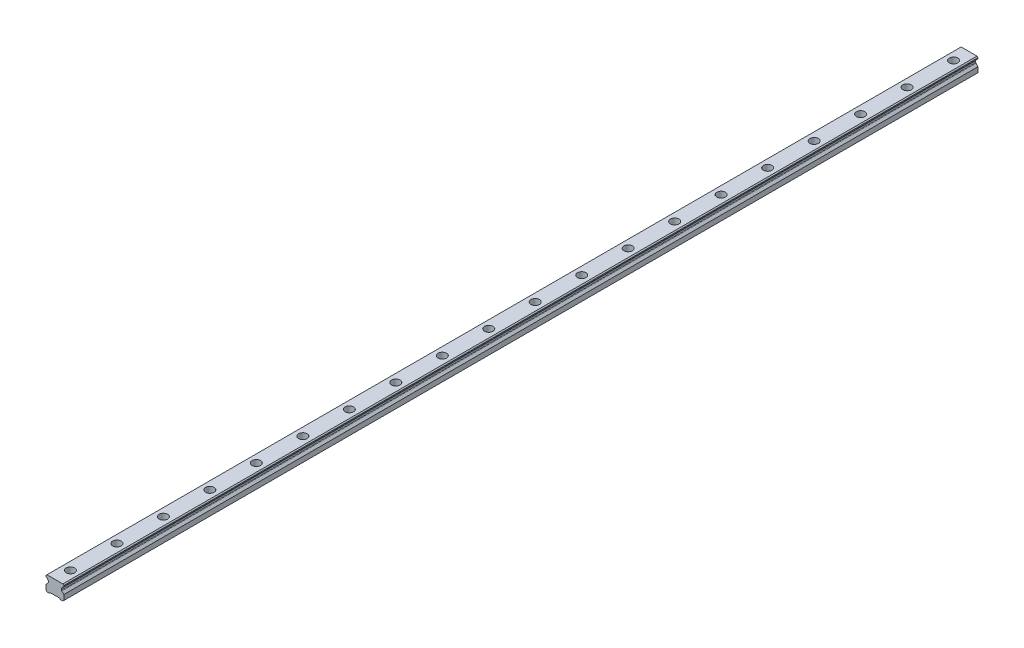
ISO-10303-21;
HEADER;
FILE_DESCRIPTION(('STEP AP214'),'2;1');
FILE_NAME('part.step','',(''),(''),'','','');
FILE_SCHEMA(('AUTOMOTIVE_DESIGN { 1 0 10303 214 1 1 1 1 }'));
ENDSEC;
DATA;
#1=APPLICATION_CONTEXT('core data for automotive mechanical design processes');
#2=APPLICATION_PROTOCOL_DEFINITION('international standard','automotive_design',2000,#1);
#3=PRODUCT_CONTEXT('',#1,'mechanical');
#4=PRODUCT('Part','Part','',(#3));
#5=PRODUCT_RELATED_PRODUCT_CATEGORY('part','',(#4));
#6=PRODUCT_DEFINITION_FORMATION('','',#4);
#7=PRODUCT_DEFINITION_CONTEXT('part definition',#1,'design');
#8=PRODUCT_DEFINITION('design','',#6,#7);
#9=PRODUCT_DEFINITION_SHAPE('','',#8);
#10=(LENGTH_UNIT() NAMED_UNIT(*) SI_UNIT(.MILLI.,.METRE.));
#11=(NAMED_UNIT(*) PLANE_ANGLE_UNIT() SI_UNIT($,.RADIAN.));
#12=(NAMED_UNIT(*) SI_UNIT($,.STERADIAN.) SOLID_ANGLE_UNIT());
#13=UNCERTAINTY_MEASURE_WITH_UNIT(LENGTH_MEASURE(1.E-05),#10,'distance_accuracy_value','');
#14=(GEOMETRIC_REPRESENTATION_CONTEXT(3) GLOBAL_UNCERTAINTY_ASSIGNED_CONTEXT((#13)) GLOBAL_UNIT_ASSIGNED_CONTEXT((#10,
#11,#12)) REPRESENTATION_CONTEXT('',''));
#15=CARTESIAN_POINT('',(0.,0.,0.));
#16=DIRECTION('',(0.,0.,1.));
#17=DIRECTION('',(1.,0.,0.));
#18=AXIS2_PLACEMENT_3D('',#15,#16,#17);
#19=CARTESIAN_POINT('',(0.,10.2,-570.));
#20=DIRECTION('',(0.,1.,0.));
#21=DIRECTION('',(0.,0.,1.));
#22=AXIS2_PLACEMENT_3D('',#19,#20,#21);
#23=PLANE('',#22);
#24=CARTESIAN_POINT('',(0.,10.2,-570.));
#25=DIRECTION('',(0.,1.,0.));
#26=DIRECTION('',(0.,0.,1.));
#27=AXIS2_PLACEMENT_3D('',#24,#25,#26);
#28=CIRCLE('',#27,3.5);
#29=CARTESIAN_POINT('',(0.,10.2,-566.5));
#30=VERTEX_POINT('',#29);
#31=EDGE_CURVE('E503',#30,#30,#28,.T.);
#32=ORIENTED_EDGE('',*,*,#31,.F.);
#33=EDGE_LOOP('',(#32));
#34=FACE_BOUND('',#33,.T.);
#35=CARTESIAN_POINT('',(0.,10.2,-570.));
#36=DIRECTION('',(0.,1.,0.));
#37=DIRECTION('',(0.,0.,1.));
#38=AXIS2_PLACEMENT_3D('',#35,#36,#37);
#39=CIRCLE('',#38,5.5);
#40=CARTESIAN_POINT('',(0.,10.2,-564.5));
#41=VERTEX_POINT('',#40);
#42=EDGE_CURVE('E11',#41,#41,#39,.T.);
#43=ORIENTED_EDGE('',*,*,#42,.T.);
#44=EDGE_LOOP('',(#43));
#45=FACE_BOUND('',#44,.T.);
#46=ADVANCED_FACE('F39',(#34,#45),#23,.T.);
#47=CARTESIAN_POINT('',(0.,10.2,-570.));
#48=DIRECTION('',(0.,1.,0.));
#49=DIRECTION('',(0.,0.,1.));
#50=AXIS2_PLACEMENT_3D('',#47,#48,#49);
#51=CYLINDRICAL_SURFACE('',#50,5.5);
#52=ORIENTED_EDGE('',*,*,#42,.F.);
#53=EDGE_LOOP('',(#52));
#54=FACE_BOUND('',#53,.T.);
#55=CARTESIAN_POINT('',(0.,19.2,-570.));
#56=DIRECTION('',(0.,1.,0.));
#57=DIRECTION('',(0.,0.,1.));
#58=AXIS2_PLACEMENT_3D('',#55,#56,#57);
#59=CIRCLE('',#58,5.5);
#60=CARTESIAN_POINT('',(0.,19.2,-564.5));
#61=VERTEX_POINT('',#60);
#62=EDGE_CURVE('E48',#61,#61,#59,.T.);
#63=ORIENTED_EDGE('',*,*,#62,.T.);
#64=EDGE_LOOP('',(#63));
#65=FACE_BOUND('',#64,.T.);
#66=ADVANCED_FACE('F807',(#54,#65),#51,.F.);
#67=CARTESIAN_POINT('',(0.,10.2,-510.));
#68=DIRECTION('',(0.,1.,0.));
#69=DIRECTION('',(0.,0.,1.));
#70=AXIS2_PLACEMENT_3D('',#67,#68,#69);
#71=PLANE('',#70);
#72=CARTESIAN_POINT('',(0.,10.2,-510.));
#73=DIRECTION('',(0.,1.,0.));
#74=DIRECTION('',(0.,0.,1.));
#75=AXIS2_PLACEMENT_3D('',#72,#73,#74);
#76=CIRCLE('',#75,3.5);
#77=CARTESIAN_POINT('',(0.,10.2,-506.5));
#78=VERTEX_POINT('',#77);
#79=EDGE_CURVE('E508',#78,#78,#76,.T.);
#80=ORIENTED_EDGE('',*,*,#79,.F.);
#81=EDGE_LOOP('',(#80));
#82=FACE_BOUND('',#81,.T.);
#83=CARTESIAN_POINT('',(0.,10.2,-510.));
#84=DIRECTION('',(0.,1.,0.));
#85=DIRECTION('',(0.,0.,1.));
#86=AXIS2_PLACEMENT_3D('',#83,#84,#85);
#87=CIRCLE('',#86,5.5);
#88=CARTESIAN_POINT('',(0.,10.2,-504.5));
#89=VERTEX_POINT('',#88);
#90=EDGE_CURVE('E487',#89,#89,#87,.T.);
#91=ORIENTED_EDGE('',*,*,#90,.T.);
#92=EDGE_LOOP('',(#91));
#93=FACE_BOUND('',#92,.T.);
#94=ADVANCED_FACE('F812',(#82,#93),#71,.T.);
#95=CARTESIAN_POINT('',(0.,10.2,-510.));
#96=DIRECTION('',(0.,1.,0.));
#97=DIRECTION('',(0.,0.,1.));
#98=AXIS2_PLACEMENT_3D('',#95,#96,#97);
#99=CYLINDRICAL_SURFACE('',#98,5.5);
#100=ORIENTED_EDGE('',*,*,#90,.F.);
#101=EDGE_LOOP('',(#100));
#102=FACE_BOUND('',#101,.T.);
#103=CARTESIAN_POINT('',(0.,19.2,-510.));
#104=DIRECTION('',(0.,1.,0.));
#105=DIRECTION('',(0.,0.,1.));
#106=AXIS2_PLACEMENT_3D('',#103,#104,#105);
#107=CIRCLE('',#106,5.5);
#108=CARTESIAN_POINT('',(0.,19.2,-504.5));
#109=VERTEX_POINT('',#108);
#110=EDGE_CURVE('E483',#109,#109,#107,.T.);
#111=ORIENTED_EDGE('',*,*,#110,.T.);
#112=EDGE_LOOP('',(#111));
#113=FACE_BOUND('',#112,.T.);
#114=ADVANCED_FACE('F993',(#102,#113),#99,.F.);
#115=CARTESIAN_POINT('',(0.,10.2,-450.));
#116=DIRECTION('',(0.,1.,0.));
#117=DIRECTION('',(0.,0.,1.));
#118=AXIS2_PLACEMENT_3D('',#115,#116,#117);
#119=PLANE('',#118);
#120=CARTESIAN_POINT('',(0.,10.2,-450.));
#121=DIRECTION('',(0.,1.,0.));
#122=DIRECTION('',(0.,0.,1.));
#123=AXIS2_PLACEMENT_3D('',#120,#121,#122);
#124=CIRCLE('',#123,3.5);
#125=CARTESIAN_POINT('',(0.,10.2,-446.5));
#126=VERTEX_POINT('',#125);
#127=EDGE_CURVE('E513',#126,#126,#124,.T.);
#128=ORIENTED_EDGE('',*,*,#127,.F.);
#129=EDGE_LOOP('',(#128));
#130=FACE_BOUND('',#129,.T.);
#131=CARTESIAN_POINT('',(0.,10.2,-450.));
#132=DIRECTION('',(0.,1.,0.));
#133=DIRECTION('',(0.,0.,1.));
#134=AXIS2_PLACEMENT_3D('',#131,#132,#133);
#135=CIRCLE('',#134,5.5);
#136=CARTESIAN_POINT('',(0.,10.2,-444.5));
#137=VERTEX_POINT('',#136);
#138=EDGE_CURVE('E479',#137,#137,#135,.T.);
#139=ORIENTED_EDGE('',*,*,#138,.T.);
#140=EDGE_LOOP('',(#139));
#141=FACE_BOUND('',#140,.T.);
#142=ADVANCED_FACE('F989',(#130,#141),#119,.T.);
#143=CARTESIAN_POINT('',(0.,10.2,-450.));
#144=DIRECTION('',(0.,1.,0.));
#145=DIRECTION('',(0.,0.,1.));
#146=AXIS2_PLACEMENT_3D('',#143,#144,#145);
#147=CYLINDRICAL_SURFACE('',#146,5.5);
#148=ORIENTED_EDGE('',*,*,#138,.F.);
#149=EDGE_LOOP('',(#148));
#150=FACE_BOUND('',#149,.T.);
#151=CARTESIAN_POINT('',(0.,19.2,-450.));
#152=DIRECTION('',(0.,1.,0.));
#153=DIRECTION('',(0.,0.,1.));
#154=AXIS2_PLACEMENT_3D('',#151,#152,#153);
#155=CIRCLE('',#154,5.5);
#156=CARTESIAN_POINT('',(0.,19.2,-444.5));
#157=VERTEX_POINT('',#156);
#158=EDGE_CURVE('E475',#157,#157,#155,.T.);
#159=ORIENTED_EDGE('',*,*,#158,.T.);
#160=EDGE_LOOP('',(#159));
#161=FACE_BOUND('',#160,.T.);
#162=ADVANCED_FACE('F985',(#150,#161),#147,.F.);
#163=CARTESIAN_POINT('',(0.,10.2,-390.));
#164=DIRECTION('',(0.,1.,0.));
#165=DIRECTION('',(0.,0.,1.));
#166=AXIS2_PLACEMENT_3D('',#163,#164,#165);
#167=PLANE('',#166);
#168=CARTESIAN_POINT('',(0.,10.2,-390.));
#169=DIRECTION('',(0.,1.,0.));
#170=DIRECTION('',(0.,0.,1.));
#171=AXIS2_PLACEMENT_3D('',#168,#169,#170);
#172=CIRCLE('',#171,3.5);
#173=CARTESIAN_POINT('',(0.,10.2,-386.5));
#174=VERTEX_POINT('',#173);
#175=EDGE_CURVE('E518',#174,#174,#172,.T.);
#176=ORIENTED_EDGE('',*,*,#175,.F.);
#177=EDGE_LOOP('',(#176));
#178=FACE_BOUND('',#177,.T.);
#179=CARTESIAN_POINT('',(0.,10.2,-390.));
#180=DIRECTION('',(0.,1.,0.));
#181=DIRECTION('',(0.,0.,1.));
#182=AXIS2_PLACEMENT_3D('',#179,#180,#181);
#183=CIRCLE('',#182,5.5);
#184=CARTESIAN_POINT('',(0.,10.2,-384.5));
#185=VERTEX_POINT('',#184);
#186=EDGE_CURVE('E471',#185,#185,#183,.T.);
#187=ORIENTED_EDGE('',*,*,#186,.T.);
#188=EDGE_LOOP('',(#187));
#189=FACE_BOUND('',#188,.T.);
#190=ADVANCED_FACE('F981',(#178,#189),#167,.T.);
#191=CARTESIAN_POINT('',(0.,10.2,-390.));
#192=DIRECTION('',(0.,1.,0.));
#193=DIRECTION('',(0.,0.,1.));
#194=AXIS2_PLACEMENT_3D('',#191,#192,#193);
#195=CYLINDRICAL_SURFACE('',#194,5.5);
#196=ORIENTED_EDGE('',*,*,#186,.F.);
#197=EDGE_LOOP('',(#196));
#198=FACE_BOUND('',#197,.T.);
#199=CARTESIAN_POINT('',(0.,19.2,-390.));
#200=DIRECTION('',(0.,1.,0.));
#201=DIRECTION('',(0.,0.,1.));
#202=AXIS2_PLACEMENT_3D('',#199,#200,#201);
#203=CIRCLE('',#202,5.5);
#204=CARTESIAN_POINT('',(0.,19.2,-384.5));
#205=VERTEX_POINT('',#204);
#206=EDGE_CURVE('E467',#205,#205,#203,.T.);
#207=ORIENTED_EDGE('',*,*,#206,.T.);
#208=EDGE_LOOP('',(#207));
#209=FACE_BOUND('',#208,.T.);
#210=ADVANCED_FACE('F977',(#198,#209),#195,.F.);
#211=CARTESIAN_POINT('',(0.,10.2,-330.));
#212=DIRECTION('',(0.,1.,0.));
#213=DIRECTION('',(0.,0.,1.));
#214=AXIS2_PLACEMENT_3D('',#211,#212,#213);
#215=PLANE('',#214);
#216=CARTESIAN_POINT('',(0.,10.2,-330.));
#217=DIRECTION('',(0.,1.,0.));
#218=DIRECTION('',(0.,0.,1.));
#219=AXIS2_PLACEMENT_3D('',#216,#217,#218);
#220=CIRCLE('',#219,3.5);
#221=CARTESIAN_POINT('',(0.,10.2,-326.5));
#222=VERTEX_POINT('',#221);
#223=EDGE_CURVE('E523',#222,#222,#220,.T.);
#224=ORIENTED_EDGE('',*,*,#223,.F.);
#225=EDGE_LOOP('',(#224));
#226=FACE_BOUND('',#225,.T.);
#227=CARTESIAN_POINT('',(0.,10.2,-330.));
#228=DIRECTION('',(0.,1.,0.));
#229=DIRECTION('',(0.,0.,1.));
#230=AXIS2_PLACEMENT_3D('',#227,#228,#229);
#231=CIRCLE('',#230,5.5);
#232=CARTESIAN_POINT('',(0.,10.2,-324.5));
#233=VERTEX_POINT('',#232);
#234=EDGE_CURVE('E463',#233,#233,#231,.T.);
#235=ORIENTED_EDGE('',*,*,#234,.T.);
#236=EDGE_LOOP('',(#235));
#237=FACE_BOUND('',#236,.T.);
#238=ADVANCED_FACE('F973',(#226,#237),#215,.T.);
#239=CARTESIAN_POINT('',(0.,10.2,-330.));
#240=DIRECTION('',(0.,1.,0.));
#241=DIRECTION('',(0.,0.,1.));
#242=AXIS2_PLACEMENT_3D('',#239,#240,#241);
#243=CYLINDRICAL_SURFACE('',#242,5.5);
#244=ORIENTED_EDGE('',*,*,#234,.F.);
#245=EDGE_LOOP('',(#244));
#246=FACE_BOUND('',#245,.T.);
#247=CARTESIAN_POINT('',(0.,19.2,-330.));
#248=DIRECTION('',(0.,1.,0.));
#249=DIRECTION('',(0.,0.,1.));
#250=AXIS2_PLACEMENT_3D('',#247,#248,#249);
#251=CIRCLE('',#250,5.5);
#252=CARTESIAN_POINT('',(0.,19.2,-324.5));
#253=VERTEX_POINT('',#252);
#254=EDGE_CURVE('E459',#253,#253,#251,.T.);
#255=ORIENTED_EDGE('',*,*,#254,.T.);
#256=EDGE_LOOP('',(#255));
#257=FACE_BOUND('',#256,.T.);
#258=ADVANCED_FACE('F969',(#246,#257),#243,.F.);
#259=CARTESIAN_POINT('',(0.,10.2,-270.));
#260=DIRECTION('',(0.,1.,0.));
#261=DIRECTION('',(0.,0.,1.));
#262=AXIS2_PLACEMENT_3D('',#259,#260,#261);
#263=PLANE('',#262);
#264=CARTESIAN_POINT('',(0.,10.2,-270.));
#265=DIRECTION('',(0.,1.,0.));
#266=DIRECTION('',(0.,0.,1.));
#267=AXIS2_PLACEMENT_3D('',#264,#265,#266);
#268=CIRCLE('',#267,3.5);
#269=CARTESIAN_POINT('',(0.,10.2,-266.5));
#270=VERTEX_POINT('',#269);
#271=EDGE_CURVE('E528',#270,#270,#268,.T.);
#272=ORIENTED_EDGE('',*,*,#271,.F.);
#273=EDGE_LOOP('',(#272));
#274=FACE_BOUND('',#273,.T.);
#275=CARTESIAN_POINT('',(0.,10.2,-270.));
#276=DIRECTION('',(0.,1.,0.));
#277=DIRECTION('',(0.,0.,1.));
#278=AXIS2_PLACEMENT_3D('',#275,#276,#277);
#279=CIRCLE('',#278,5.5);
#280=CARTESIAN_POINT('',(0.,10.2,-264.5));
#281=VERTEX_POINT('',#280);
#282=EDGE_CURVE('E455',#281,#281,#279,.T.);
#283=ORIENTED_EDGE('',*,*,#282,.T.);
#284=EDGE_LOOP('',(#283));
#285=FACE_BOUND('',#284,.T.);
#286=ADVANCED_FACE('F965',(#274,#285),#263,.T.);
#287=CARTESIAN_POINT('',(0.,10.2,-270.));
#288=DIRECTION('',(0.,1.,0.));
#289=DIRECTION('',(0.,0.,1.));
#290=AXIS2_PLACEMENT_3D('',#287,#288,#289);
#291=CYLINDRICAL_SURFACE('',#290,5.5);
#292=ORIENTED_EDGE('',*,*,#282,.F.);
#293=EDGE_LOOP('',(#292));
#294=FACE_BOUND('',#293,.T.);
#295=CARTESIAN_POINT('',(0.,19.2,-270.));
#296=DIRECTION('',(0.,1.,0.));
#297=DIRECTION('',(0.,0.,1.));
#298=AXIS2_PLACEMENT_3D('',#295,#296,#297);
#299=CIRCLE('',#298,5.5);
#300=CARTESIAN_POINT('',(0.,19.2,-264.5));
#301=VERTEX_POINT('',#300);
#302=EDGE_CURVE('E451',#301,#301,#299,.T.);
#303=ORIENTED_EDGE('',*,*,#302,.T.);
#304=EDGE_LOOP('',(#303));
#305=FACE_BOUND('',#304,.T.);
#306=ADVANCED_FACE('F961',(#294,#305),#291,.F.);
#307=CARTESIAN_POINT('',(0.,10.2,-210.));
#308=DIRECTION('',(0.,1.,0.));
#309=DIRECTION('',(0.,0.,1.));
#310=AXIS2_PLACEMENT_3D('',#307,#308,#309);
#311=PLANE('',#310);
#312=CARTESIAN_POINT('',(0.,10.2,-210.));
#313=DIRECTION('',(0.,1.,0.));
#314=DIRECTION('',(0.,0.,1.));
#315=AXIS2_PLACEMENT_3D('',#312,#313,#314);
#316=CIRCLE('',#315,3.5);
#317=CARTESIAN_POINT('',(0.,10.2,-206.5));
#318=VERTEX_POINT('',#317);
#319=EDGE_CURVE('E533',#318,#318,#316,.T.);
#320=ORIENTED_EDGE('',*,*,#319,.F.);
#321=EDGE_LOOP('',(#320));
#322=FACE_BOUND('',#321,.T.);
#323=CARTESIAN_POINT('',(0.,10.2,-210.));
#324=DIRECTION('',(0.,1.,0.));
#325=DIRECTION('',(0.,0.,1.));
#326=AXIS2_PLACEMENT_3D('',#323,#324,#325);
#327=CIRCLE('',#326,5.5);
#328=CARTESIAN_POINT('',(0.,10.2,-204.5));
#329=VERTEX_POINT('',#328);
#330=EDGE_CURVE('E447',#329,#329,#327,.T.);
#331=ORIENTED_EDGE('',*,*,#330,.T.);
#332=EDGE_LOOP('',(#331));
#333=FACE_BOUND('',#332,.T.);
#334=ADVANCED_FACE('F957',(#322,#333),#311,.T.);
#335=CARTESIAN_POINT('',(0.,10.2,-210.));
#336=DIRECTION('',(0.,1.,0.));
#337=DIRECTION('',(0.,0.,1.));
#338=AXIS2_PLACEMENT_3D('',#335,#336,#337);
#339=CYLINDRICAL_SURFACE('',#338,5.5);
#340=ORIENTED_EDGE('',*,*,#330,.F.);
#341=EDGE_LOOP('',(#340));
#342=FACE_BOUND('',#341,.T.);
#343=CARTESIAN_POINT('',(0.,19.2,-210.));
#344=DIRECTION('',(0.,1.,0.));
#345=DIRECTION('',(0.,0.,1.));
#346=AXIS2_PLACEMENT_3D('',#343,#344,#345);
#347=CIRCLE('',#346,5.5);
#348=CARTESIAN_POINT('',(0.,19.2,-204.5));
#349=VERTEX_POINT('',#348);
#350=EDGE_CURVE('E443',#349,#349,#347,.T.);
#351=ORIENTED_EDGE('',*,*,#350,.T.);
#352=EDGE_LOOP('',(#351));
#353=FACE_BOUND('',#352,.T.);
#354=ADVANCED_FACE('F953',(#342,#353),#339,.F.);
#355=CARTESIAN_POINT('',(0.,10.2,-150.));
#356=DIRECTION('',(0.,1.,0.));
#357=DIRECTION('',(0.,0.,1.));
#358=AXIS2_PLACEMENT_3D('',#355,#356,#357);
#359=PLANE('',#358);
#360=CARTESIAN_POINT('',(0.,10.2,-150.));
#361=DIRECTION('',(0.,1.,0.));
#362=DIRECTION('',(0.,0.,1.));
#363=AXIS2_PLACEMENT_3D('',#360,#361,#362);
#364=CIRCLE('',#363,3.5);
#365=CARTESIAN_POINT('',(0.,10.2,-146.5));
#366=VERTEX_POINT('',#365);
#367=EDGE_CURVE('E538',#366,#366,#364,.T.);
#368=ORIENTED_EDGE('',*,*,#367,.F.);
#369=EDGE_LOOP('',(#368));
#370=FACE_BOUND('',#369,.T.);
#371=CARTESIAN_POINT('',(0.,10.2,-150.));
#372=DIRECTION('',(0.,1.,0.));
#373=DIRECTION('',(0.,0.,1.));
#374=AXIS2_PLACEMENT_3D('',#371,#372,#373);
#375=CIRCLE('',#374,5.5);
#376=CARTESIAN_POINT('',(0.,10.2,-144.5));
#377=VERTEX_POINT('',#376);
#378=EDGE_CURVE('E439',#377,#377,#375,.T.);
#379=ORIENTED_EDGE('',*,*,#378,.T.);
#380=EDGE_LOOP('',(#379));
#381=FACE_BOUND('',#380,.T.);
#382=ADVANCED_FACE('F949',(#370,#381),#359,.T.);
#383=CARTESIAN_POINT('',(0.,10.2,-150.));
#384=DIRECTION('',(0.,1.,0.));
#385=DIRECTION('',(0.,0.,1.));
#386=AXIS2_PLACEMENT_3D('',#383,#384,#385);
#387=CYLINDRICAL_SURFACE('',#386,5.5);
#388=ORIENTED_EDGE('',*,*,#378,.F.);
#389=EDGE_LOOP('',(#388));
#390=FACE_BOUND('',#389,.T.);
#391=CARTESIAN_POINT('',(0.,19.2,-150.));
#392=DIRECTION('',(0.,1.,0.));
#393=DIRECTION('',(0.,0.,1.));
#394=AXIS2_PLACEMENT_3D('',#391,#392,#393);
#395=CIRCLE('',#394,5.5);
#396=CARTESIAN_POINT('',(0.,19.2,-144.5));
#397=VERTEX_POINT('',#396);
#398=EDGE_CURVE('E435',#397,#397,#395,.T.);
#399=ORIENTED_EDGE('',*,*,#398,.T.);
#400=EDGE_LOOP('',(#399));
#401=FACE_BOUND('',#400,.T.);
#402=ADVANCED_FACE('F945',(#390,#401),#387,.F.);
#403=CARTESIAN_POINT('',(0.,10.2,-89.9999999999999));
#404=DIRECTION('',(0.,1.,0.));
#405=DIRECTION('',(0.,0.,1.));
#406=AXIS2_PLACEMENT_3D('',#403,#404,#405);
#407=PLANE('',#406);
#408=CARTESIAN_POINT('',(0.,10.2,-90.));
#409=DIRECTION('',(0.,1.,0.));
#410=DIRECTION('',(0.,0.,1.));
#411=AXIS2_PLACEMENT_3D('',#408,#409,#410);
#412=CIRCLE('',#411,3.5);
#413=CARTESIAN_POINT('',(0.,10.2,-86.5));
#414=VERTEX_POINT('',#413);
#415=EDGE_CURVE('E543',#414,#414,#412,.T.);
#416=ORIENTED_EDGE('',*,*,#415,.F.);
#417=EDGE_LOOP('',(#416));
#418=FACE_BOUND('',#417,.T.);
#419=CARTESIAN_POINT('',(0.,10.2,-89.9999999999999));
#420=DIRECTION('',(0.,1.,0.));
#421=DIRECTION('',(0.,0.,1.));
#422=AXIS2_PLACEMENT_3D('',#419,#420,#421);
#423=CIRCLE('',#422,5.5);
#424=CARTESIAN_POINT('',(0.,10.2,-84.4999999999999));
#425=VERTEX_POINT('',#424);
#426=EDGE_CURVE('E431',#425,#425,#423,.T.);
#427=ORIENTED_EDGE('',*,*,#426,.T.);
#428=EDGE_LOOP('',(#427));
#429=FACE_BOUND('',#428,.T.);
#430=ADVANCED_FACE('F941',(#418,#429),#407,.T.);
#431=CARTESIAN_POINT('',(0.,10.2,-89.9999999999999));
#432=DIRECTION('',(0.,1.,0.));
#433=DIRECTION('',(0.,0.,1.));
#434=AXIS2_PLACEMENT_3D('',#431,#432,#433);
#435=CYLINDRICAL_SURFACE('',#434,5.5);
#436=ORIENTED_EDGE('',*,*,#426,.F.);
#437=EDGE_LOOP('',(#436));
#438=FACE_BOUND('',#437,.T.);
#439=CARTESIAN_POINT('',(0.,19.2,-89.9999999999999));
#440=DIRECTION('',(0.,1.,0.));
#441=DIRECTION('',(0.,0.,1.));
#442=AXIS2_PLACEMENT_3D('',#439,#440,#441);
#443=CIRCLE('',#442,5.5);
#444=CARTESIAN_POINT('',(0.,19.2,-84.4999999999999));
#445=VERTEX_POINT('',#444);
#446=EDGE_CURVE('E427',#445,#445,#443,.T.);
#447=ORIENTED_EDGE('',*,*,#446,.T.);
#448=EDGE_LOOP('',(#447));
#449=FACE_BOUND('',#448,.T.);
#450=ADVANCED_FACE('F937',(#438,#449),#435,.F.);
#451=CARTESIAN_POINT('',(0.,10.2,-30.));
#452=DIRECTION('',(0.,1.,0.));
#453=DIRECTION('',(0.,0.,1.));
#454=AXIS2_PLACEMENT_3D('',#451,#452,#453);
#455=PLANE('',#454);
#456=CARTESIAN_POINT('',(0.,10.2,-30.));
#457=DIRECTION('',(0.,1.,0.));
#458=DIRECTION('',(0.,0.,1.));
#459=AXIS2_PLACEMENT_3D('',#456,#457,#458);
#460=CIRCLE('',#459,3.5);
#461=CARTESIAN_POINT('',(0.,10.2,-26.5));
#462=VERTEX_POINT('',#461);
#463=EDGE_CURVE('E548',#462,#462,#460,.T.);
#464=ORIENTED_EDGE('',*,*,#463,.F.);
#465=EDGE_LOOP('',(#464));
#466=FACE_BOUND('',#465,.T.);
#467=CARTESIAN_POINT('',(0.,10.2,-30.));
#468=DIRECTION('',(0.,1.,0.));
#469=DIRECTION('',(0.,0.,1.));
#470=AXIS2_PLACEMENT_3D('',#467,#468,#469);
#471=CIRCLE('',#470,5.5);
#472=CARTESIAN_POINT('',(0.,10.2,-24.5));
#473=VERTEX_POINT('',#472);
#474=EDGE_CURVE('E423',#473,#473,#471,.T.);
#475=ORIENTED_EDGE('',*,*,#474,.T.);
#476=EDGE_LOOP('',(#475));
#477=FACE_BOUND('',#476,.T.);
#478=ADVANCED_FACE('F933',(#466,#477),#455,.T.);
#479=CARTESIAN_POINT('',(0.,10.2,-30.));
#480=DIRECTION('',(0.,1.,0.));
#481=DIRECTION('',(0.,0.,1.));
#482=AXIS2_PLACEMENT_3D('',#479,#480,#481);
#483=CYLINDRICAL_SURFACE('',#482,5.5);
#484=ORIENTED_EDGE('',*,*,#474,.F.);
#485=EDGE_LOOP('',(#484));
#486=FACE_BOUND('',#485,.T.);
#487=CARTESIAN_POINT('',(0.,19.2,-30.));
#488=DIRECTION('',(0.,1.,0.));
#489=DIRECTION('',(0.,0.,1.));
#490=AXIS2_PLACEMENT_3D('',#487,#488,#489);
#491=CIRCLE('',#490,5.5);
#492=CARTESIAN_POINT('',(0.,19.2,-24.5));
#493=VERTEX_POINT('',#492);
#494=EDGE_CURVE('E419',#493,#493,#491,.T.);
#495=ORIENTED_EDGE('',*,*,#494,.T.);
#496=EDGE_LOOP('',(#495));
#497=FACE_BOUND('',#496,.T.);
#498=ADVANCED_FACE('F929',(#486,#497),#483,.F.);
#499=CARTESIAN_POINT('',(0.,10.2,30.));
#500=DIRECTION('',(0.,1.,0.));
#501=DIRECTION('',(0.,0.,1.));
#502=AXIS2_PLACEMENT_3D('',#499,#500,#501);
#503=PLANE('',#502);
#504=CARTESIAN_POINT('',(0.,10.2,29.9999999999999));
#505=DIRECTION('',(0.,1.,0.));
#506=DIRECTION('',(0.,0.,1.));
#507=AXIS2_PLACEMENT_3D('',#504,#505,#506);
#508=CIRCLE('',#507,3.5);
#509=CARTESIAN_POINT('',(0.,10.2,33.4999999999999));
#510=VERTEX_POINT('',#509);
#511=EDGE_CURVE('E553',#510,#510,#508,.T.);
#512=ORIENTED_EDGE('',*,*,#511,.F.);
#513=EDGE_LOOP('',(#512));
#514=FACE_BOUND('',#513,.T.);
#515=CARTESIAN_POINT('',(0.,10.2,30.));
#516=DIRECTION('',(0.,1.,0.));
#517=DIRECTION('',(0.,0.,1.));
#518=AXIS2_PLACEMENT_3D('',#515,#516,#517);
#519=CIRCLE('',#518,5.5);
#520=CARTESIAN_POINT('',(0.,10.2,35.5));
#521=VERTEX_POINT('',#520);
#522=EDGE_CURVE('E415',#521,#521,#519,.T.);
#523=ORIENTED_EDGE('',*,*,#522,.T.);
#524=EDGE_LOOP('',(#523));
#525=FACE_BOUND('',#524,.T.);
#526=ADVANCED_FACE('F925',(#514,#525),#503,.T.);
#527=CARTESIAN_POINT('',(0.,10.2,30.));
#528=DIRECTION('',(0.,1.,0.));
#529=DIRECTION('',(0.,0.,1.));
#530=AXIS2_PLACEMENT_3D('',#527,#528,#529);
#531=CYLINDRICAL_SURFACE('',#530,5.5);
#532=ORIENTED_EDGE('',*,*,#522,.F.);
#533=EDGE_LOOP('',(#532));
#534=FACE_BOUND('',#533,.T.);
#535=CARTESIAN_POINT('',(0.,19.2,30.));
#536=DIRECTION('',(0.,1.,0.));
#537=DIRECTION('',(0.,0.,1.));
#538=AXIS2_PLACEMENT_3D('',#535,#536,#537);
#539=CIRCLE('',#538,5.5);
#540=CARTESIAN_POINT('',(0.,19.2,35.5));
#541=VERTEX_POINT('',#540);
#542=EDGE_CURVE('E411',#541,#541,#539,.T.);
#543=ORIENTED_EDGE('',*,*,#542,.T.);
#544=EDGE_LOOP('',(#543));
#545=FACE_BOUND('',#544,.T.);
#546=ADVANCED_FACE('F921',(#534,#545),#531,.F.);
#547=CARTESIAN_POINT('',(0.,10.2,90.));
#548=DIRECTION('',(0.,1.,0.));
#549=DIRECTION('',(0.,0.,1.));
#550=AXIS2_PLACEMENT_3D('',#547,#548,#549);
#551=PLANE('',#550);
#552=CARTESIAN_POINT('',(0.,10.2,90.));
#553=DIRECTION('',(0.,1.,0.));
#554=DIRECTION('',(0.,0.,1.));
#555=AXIS2_PLACEMENT_3D('',#552,#553,#554);
#556=CIRCLE('',#555,3.5);
#557=CARTESIAN_POINT('',(0.,10.2,93.5));
#558=VERTEX_POINT('',#557);
#559=EDGE_CURVE('E558',#558,#558,#556,.T.);
#560=ORIENTED_EDGE('',*,*,#559,.F.);
#561=EDGE_LOOP('',(#560));
#562=FACE_BOUND('',#561,.T.);
#563=CARTESIAN_POINT('',(0.,10.2,90.));
#564=DIRECTION('',(0.,1.,0.));
#565=DIRECTION('',(0.,0.,1.));
#566=AXIS2_PLACEMENT_3D('',#563,#564,#565);
#567=CIRCLE('',#566,5.5);
#568=CARTESIAN_POINT('',(0.,10.2,95.5));
#569=VERTEX_POINT('',#568);
#570=EDGE_CURVE('E407',#569,#569,#567,.T.);
#571=ORIENTED_EDGE('',*,*,#570,.T.);
#572=EDGE_LOOP('',(#571));
#573=FACE_BOUND('',#572,.T.);
#574=ADVANCED_FACE('F917',(#562,#573),#551,.T.);
#575=CARTESIAN_POINT('',(0.,10.2,90.));
#576=DIRECTION('',(0.,1.,0.));
#577=DIRECTION('',(0.,0.,1.));
#578=AXIS2_PLACEMENT_3D('',#575,#576,#577);
#579=CYLINDRICAL_SURFACE('',#578,5.5);
#580=ORIENTED_EDGE('',*,*,#570,.F.);
#581=EDGE_LOOP('',(#580));
#582=FACE_BOUND('',#581,.T.);
#583=CARTESIAN_POINT('',(0.,19.2,90.));
#584=DIRECTION('',(0.,1.,0.));
#585=DIRECTION('',(0.,0.,1.));
#586=AXIS2_PLACEMENT_3D('',#583,#584,#585);
#587=CIRCLE('',#586,5.5);
#588=CARTESIAN_POINT('',(0.,19.2,95.5));
#589=VERTEX_POINT('',#588);
#590=EDGE_CURVE('E403',#589,#589,#587,.T.);
#591=ORIENTED_EDGE('',*,*,#590,.T.);
#592=EDGE_LOOP('',(#591));
#593=FACE_BOUND('',#592,.T.);
#594=ADVANCED_FACE('F913',(#582,#593),#579,.F.);
#595=CARTESIAN_POINT('',(0.,10.2,150.));
#596=DIRECTION('',(0.,1.,0.));
#597=DIRECTION('',(0.,0.,1.));
#598=AXIS2_PLACEMENT_3D('',#595,#596,#597);
#599=PLANE('',#598);
#600=CARTESIAN_POINT('',(0.,10.2,150.));
#601=DIRECTION('',(0.,1.,0.));
#602=DIRECTION('',(0.,0.,1.));
#603=AXIS2_PLACEMENT_3D('',#600,#601,#602);
#604=CIRCLE('',#603,3.5);
#605=CARTESIAN_POINT('',(0.,10.2,153.5));
#606=VERTEX_POINT('',#605);
#607=EDGE_CURVE('E563',#606,#606,#604,.T.);
#608=ORIENTED_EDGE('',*,*,#607,.F.);
#609=EDGE_LOOP('',(#608));
#610=FACE_BOUND('',#609,.T.);
#611=CARTESIAN_POINT('',(0.,10.2,150.));
#612=DIRECTION('',(0.,1.,0.));
#613=DIRECTION('',(0.,0.,1.));
#614=AXIS2_PLACEMENT_3D('',#611,#612,#613);
#615=CIRCLE('',#614,5.5);
#616=CARTESIAN_POINT('',(0.,10.2,155.5));
#617=VERTEX_POINT('',#616);
#618=EDGE_CURVE('E399',#617,#617,#615,.T.);
#619=ORIENTED_EDGE('',*,*,#618,.T.);
#620=EDGE_LOOP('',(#619));
#621=FACE_BOUND('',#620,.T.);
#622=ADVANCED_FACE('F909',(#610,#621),#599,.T.);
#623=CARTESIAN_POINT('',(0.,10.2,150.));
#624=DIRECTION('',(0.,1.,0.));
#625=DIRECTION('',(0.,0.,1.));
#626=AXIS2_PLACEMENT_3D('',#623,#624,#625);
#627=CYLINDRICAL_SURFACE('',#626,5.5);
#628=ORIENTED_EDGE('',*,*,#618,.F.);
#629=EDGE_LOOP('',(#628));
#630=FACE_BOUND('',#629,.T.);
#631=CARTESIAN_POINT('',(0.,19.2,150.));
#632=DIRECTION('',(0.,1.,0.));
#633=DIRECTION('',(0.,0.,1.));
#634=AXIS2_PLACEMENT_3D('',#631,#632,#633);
#635=CIRCLE('',#634,5.5);
#636=CARTESIAN_POINT('',(0.,19.2,155.5));
#637=VERTEX_POINT('',#636);
#638=EDGE_CURVE('E395',#637,#637,#635,.T.);
#639=ORIENTED_EDGE('',*,*,#638,.T.);
#640=EDGE_LOOP('',(#639));
#641=FACE_BOUND('',#640,.T.);
#642=ADVANCED_FACE('F905',(#630,#641),#627,.F.);
#643=CARTESIAN_POINT('',(0.,10.2,210.));
#644=DIRECTION('',(0.,1.,0.));
#645=DIRECTION('',(0.,0.,1.));
#646=AXIS2_PLACEMENT_3D('',#643,#644,#645);
#647=PLANE('',#646);
#648=CARTESIAN_POINT('',(0.,10.2,210.));
#649=DIRECTION('',(0.,1.,0.));
#650=DIRECTION('',(0.,0.,1.));
#651=AXIS2_PLACEMENT_3D('',#648,#649,#650);
#652=CIRCLE('',#651,3.5);
#653=CARTESIAN_POINT('',(0.,10.2,213.5));
#654=VERTEX_POINT('',#653);
#655=EDGE_CURVE('E568',#654,#654,#652,.T.);
#656=ORIENTED_EDGE('',*,*,#655,.F.);
#657=EDGE_LOOP('',(#656));
#658=FACE_BOUND('',#657,.T.);
#659=CARTESIAN_POINT('',(0.,10.2,210.));
#660=DIRECTION('',(0.,1.,0.));
#661=DIRECTION('',(0.,0.,1.));
#662=AXIS2_PLACEMENT_3D('',#659,#660,#661);
#663=CIRCLE('',#662,5.5);
#664=CARTESIAN_POINT('',(0.,10.2,215.5));
#665=VERTEX_POINT('',#664);
#666=EDGE_CURVE('E391',#665,#665,#663,.T.);
#667=ORIENTED_EDGE('',*,*,#666,.T.);
#668=EDGE_LOOP('',(#667));
#669=FACE_BOUND('',#668,.T.);
#670=ADVANCED_FACE('F901',(#658,#669),#647,.T.);
#671=CARTESIAN_POINT('',(0.,10.2,210.));
#672=DIRECTION('',(0.,1.,0.));
#673=DIRECTION('',(0.,0.,1.));
#674=AXIS2_PLACEMENT_3D('',#671,#672,#673);
#675=CYLINDRICAL_SURFACE('',#674,5.5);
#676=ORIENTED_EDGE('',*,*,#666,.F.);
#677=EDGE_LOOP('',(#676));
#678=FACE_BOUND('',#677,.T.);
#679=CARTESIAN_POINT('',(0.,19.2,210.));
#680=DIRECTION('',(0.,1.,0.));
#681=DIRECTION('',(0.,0.,1.));
#682=AXIS2_PLACEMENT_3D('',#679,#680,#681);
#683=CIRCLE('',#682,5.5);
#684=CARTESIAN_POINT('',(0.,19.2,215.5));
#685=VERTEX_POINT('',#684);
#686=EDGE_CURVE('E387',#685,#685,#683,.T.);
#687=ORIENTED_EDGE('',*,*,#686,.T.);
#688=EDGE_LOOP('',(#687));
#689=FACE_BOUND('',#688,.T.);
#690=ADVANCED_FACE('F897',(#678,#689),#675,.F.);
#691=CARTESIAN_POINT('',(0.,10.2,270.));
#692=DIRECTION('',(0.,1.,0.));
#693=DIRECTION('',(0.,0.,1.));
#694=AXIS2_PLACEMENT_3D('',#691,#692,#693);
#695=PLANE('',#694);
#696=CARTESIAN_POINT('',(0.,10.2,270.));
#697=DIRECTION('',(0.,1.,0.));
#698=DIRECTION('',(0.,0.,1.));
#699=AXIS2_PLACEMENT_3D('',#696,#697,#698);
#700=CIRCLE('',#699,3.5);
#701=CARTESIAN_POINT('',(0.,10.2,273.5));
#702=VERTEX_POINT('',#701);
#703=EDGE_CURVE('E573',#702,#702,#700,.T.);
#704=ORIENTED_EDGE('',*,*,#703,.F.);
#705=EDGE_LOOP('',(#704));
#706=FACE_BOUND('',#705,.T.);
#707=CARTESIAN_POINT('',(0.,10.2,270.));
#708=DIRECTION('',(0.,1.,0.));
#709=DIRECTION('',(0.,0.,1.));
#710=AXIS2_PLACEMENT_3D('',#707,#708,#709);
#711=CIRCLE('',#710,5.5);
#712=CARTESIAN_POINT('',(0.,10.2,275.5));
#713=VERTEX_POINT('',#712);
#714=EDGE_CURVE('E383',#713,#713,#711,.T.);
#715=ORIENTED_EDGE('',*,*,#714,.T.);
#716=EDGE_LOOP('',(#715));
#717=FACE_BOUND('',#716,.T.);
#718=ADVANCED_FACE('F893',(#706,#717),#695,.T.);
#719=CARTESIAN_POINT('',(0.,10.2,270.));
#720=DIRECTION('',(0.,1.,0.));
#721=DIRECTION('',(0.,0.,1.));
#722=AXIS2_PLACEMENT_3D('',#719,#720,#721);
#723=CYLINDRICAL_SURFACE('',#722,5.5);
#724=ORIENTED_EDGE('',*,*,#714,.F.);
#725=EDGE_LOOP('',(#724));
#726=FACE_BOUND('',#725,.T.);
#727=CARTESIAN_POINT('',(0.,19.2,270.));
#728=DIRECTION('',(0.,1.,0.));
#729=DIRECTION('',(0.,0.,1.));
#730=AXIS2_PLACEMENT_3D('',#727,#728,#729);
#731=CIRCLE('',#730,5.5);
#732=CARTESIAN_POINT('',(0.,19.2,275.5));
#733=VERTEX_POINT('',#732);
#734=EDGE_CURVE('E379',#733,#733,#731,.T.);
#735=ORIENTED_EDGE('',*,*,#734,.T.);
#736=EDGE_LOOP('',(#735));
#737=FACE_BOUND('',#736,.T.);
#738=ADVANCED_FACE('F889',(#726,#737),#723,.F.);
#739=CARTESIAN_POINT('',(0.,10.2,330.));
#740=DIRECTION('',(0.,1.,0.));
#741=DIRECTION('',(0.,0.,1.));
#742=AXIS2_PLACEMENT_3D('',#739,#740,#741);
#743=PLANE('',#742);
#744=CARTESIAN_POINT('',(0.,10.2,330.));
#745=DIRECTION('',(0.,1.,0.));
#746=DIRECTION('',(0.,0.,1.));
#747=AXIS2_PLACEMENT_3D('',#744,#745,#746);
#748=CIRCLE('',#747,3.5);
#749=CARTESIAN_POINT('',(0.,10.2,333.5));
#750=VERTEX_POINT('',#749);
#751=EDGE_CURVE('E577',#750,#750,#748,.T.);
#752=ORIENTED_EDGE('',*,*,#751,.F.);
#753=EDGE_LOOP('',(#752));
#754=FACE_BOUND('',#753,.T.);
#755=CARTESIAN_POINT('',(0.,10.2,330.));
#756=DIRECTION('',(0.,1.,0.));
#757=DIRECTION('',(0.,0.,1.));
#758=AXIS2_PLACEMENT_3D('',#755,#756,#757);
#759=CIRCLE('',#758,5.5);
#760=CARTESIAN_POINT('',(0.,10.2,335.5));
#761=VERTEX_POINT('',#760);
#762=EDGE_CURVE('E375',#761,#761,#759,.T.);
#763=ORIENTED_EDGE('',*,*,#762,.T.);
#764=EDGE_LOOP('',(#763));
#765=FACE_BOUND('',#764,.T.);
#766=ADVANCED_FACE('F885',(#754,#765),#743,.T.);
#767=CARTESIAN_POINT('',(0.,10.2,330.));
#768=DIRECTION('',(0.,1.,0.));
#769=DIRECTION('',(0.,0.,1.));
#770=AXIS2_PLACEMENT_3D('',#767,#768,#769);
#771=CYLINDRICAL_SURFACE('',#770,5.5);
#772=ORIENTED_EDGE('',*,*,#762,.F.);
#773=EDGE_LOOP('',(#772));
#774=FACE_BOUND('',#773,.T.);
#775=CARTESIAN_POINT('',(0.,19.2,330.));
#776=DIRECTION('',(0.,1.,0.));
#777=DIRECTION('',(0.,0.,1.));
#778=AXIS2_PLACEMENT_3D('',#775,#776,#777);
#779=CIRCLE('',#778,5.5);
#780=CARTESIAN_POINT('',(0.,19.2,335.5));
#781=VERTEX_POINT('',#780);
#782=EDGE_CURVE('E371',#781,#781,#779,.T.);
#783=ORIENTED_EDGE('',*,*,#782,.T.);
#784=EDGE_LOOP('',(#783));
#785=FACE_BOUND('',#784,.T.);
#786=ADVANCED_FACE('F881',(#774,#785),#771,.F.);
#787=CARTESIAN_POINT('',(0.,10.2,390.));
#788=DIRECTION('',(0.,1.,0.));
#789=DIRECTION('',(0.,0.,1.));
#790=AXIS2_PLACEMENT_3D('',#787,#788,#789);
#791=PLANE('',#790);
#792=CARTESIAN_POINT('',(0.,10.2,390.));
#793=DIRECTION('',(0.,1.,0.));
#794=DIRECTION('',(0.,0.,1.));
#795=AXIS2_PLACEMENT_3D('',#792,#793,#794);
#796=CIRCLE('',#795,3.5);
#797=CARTESIAN_POINT('',(0.,10.2,393.5));
#798=VERTEX_POINT('',#797);
#799=EDGE_CURVE('E581',#798,#798,#796,.T.);
#800=ORIENTED_EDGE('',*,*,#799,.F.);
#801=EDGE_LOOP('',(#800));
#802=FACE_BOUND('',#801,.T.);
#803=CARTESIAN_POINT('',(0.,10.2,390.));
#804=DIRECTION('',(0.,1.,0.));
#805=DIRECTION('',(0.,0.,1.));
#806=AXIS2_PLACEMENT_3D('',#803,#804,#805);
#807=CIRCLE('',#806,5.5);
#808=CARTESIAN_POINT('',(0.,10.2,395.5));
#809=VERTEX_POINT('',#808);
#810=EDGE_CURVE('E367',#809,#809,#807,.T.);
#811=ORIENTED_EDGE('',*,*,#810,.T.);
#812=EDGE_LOOP('',(#811));
#813=FACE_BOUND('',#812,.T.);
#814=ADVANCED_FACE('F877',(#802,#813),#791,.T.);
#815=CARTESIAN_POINT('',(0.,10.2,390.));
#816=DIRECTION('',(0.,1.,0.));
#817=DIRECTION('',(0.,0.,1.));
#818=AXIS2_PLACEMENT_3D('',#815,#816,#817);
#819=CYLINDRICAL_SURFACE('',#818,5.5);
#820=ORIENTED_EDGE('',*,*,#810,.F.);
#821=EDGE_LOOP('',(#820));
#822=FACE_BOUND('',#821,.T.);
#823=CARTESIAN_POINT('',(0.,19.2,390.));
#824=DIRECTION('',(0.,1.,0.));
#825=DIRECTION('',(0.,0.,1.));
#826=AXIS2_PLACEMENT_3D('',#823,#824,#825);
#827=CIRCLE('',#826,5.5);
#828=CARTESIAN_POINT('',(0.,19.2,395.5));
#829=VERTEX_POINT('',#828);
#830=EDGE_CURVE('E363',#829,#829,#827,.T.);
#831=ORIENTED_EDGE('',*,*,#830,.T.);
#832=EDGE_LOOP('',(#831));
#833=FACE_BOUND('',#832,.T.);
#834=ADVANCED_FACE('F873',(#822,#833),#819,.F.);
#835=CARTESIAN_POINT('',(0.,10.2,450.));
#836=DIRECTION('',(0.,1.,0.));
#837=DIRECTION('',(0.,0.,1.));
#838=AXIS2_PLACEMENT_3D('',#835,#836,#837);
#839=PLANE('',#838);
#840=CARTESIAN_POINT('',(0.,10.2,450.));
#841=DIRECTION('',(0.,1.,0.));
#842=DIRECTION('',(0.,0.,1.));
#843=AXIS2_PLACEMENT_3D('',#840,#841,#842);
#844=CIRCLE('',#843,3.5);
#845=CARTESIAN_POINT('',(0.,10.2,453.5));
#846=VERTEX_POINT('',#845);
#847=EDGE_CURVE('E598',#846,#846,#844,.T.);
#848=ORIENTED_EDGE('',*,*,#847,.F.);
#849=EDGE_LOOP('',(#848));
#850=FACE_BOUND('',#849,.T.);
#851=CARTESIAN_POINT('',(0.,10.2,450.));
#852=DIRECTION('',(0.,1.,0.));
#853=DIRECTION('',(0.,0.,1.));
#854=AXIS2_PLACEMENT_3D('',#851,#852,#853);
#855=CIRCLE('',#854,5.5);
#856=CARTESIAN_POINT('',(0.,10.2,455.5));
#857=VERTEX_POINT('',#856);
#858=EDGE_CURVE('E359',#857,#857,#855,.T.);
#859=ORIENTED_EDGE('',*,*,#858,.T.);
#860=EDGE_LOOP('',(#859));
#861=FACE_BOUND('',#860,.T.);
#862=ADVANCED_FACE('F869',(#850,#861),#839,.T.);
#863=CARTESIAN_POINT('',(0.,10.2,450.));
#864=DIRECTION('',(0.,1.,0.));
#865=DIRECTION('',(0.,0.,1.));
#866=AXIS2_PLACEMENT_3D('',#863,#864,#865);
#867=CYLINDRICAL_SURFACE('',#866,5.5);
#868=ORIENTED_EDGE('',*,*,#858,.F.);
#869=EDGE_LOOP('',(#868));
#870=FACE_BOUND('',#869,.T.);
#871=CARTESIAN_POINT('',(0.,19.2,450.));
#872=DIRECTION('',(0.,1.,0.));
#873=DIRECTION('',(0.,0.,1.));
#874=AXIS2_PLACEMENT_3D('',#871,#872,#873);
#875=CIRCLE('',#874,5.5);
#876=CARTESIAN_POINT('',(0.,19.2,455.5));
#877=VERTEX_POINT('',#876);
#878=EDGE_CURVE('E355',#877,#877,#875,.T.);
#879=ORIENTED_EDGE('',*,*,#878,.T.);
#880=EDGE_LOOP('',(#879));
#881=FACE_BOUND('',#880,.T.);
#882=ADVANCED_FACE('F866',(#870,#881),#867,.F.);
#883=CARTESIAN_POINT('',(11.5,0.,590.));
#884=DIRECTION('',(0.,1.,0.));
#885=DIRECTION('',(-1.,0.,0.));
#886=AXIS2_PLACEMENT_3D('',#883,#884,#885);
#887=PLANE('',#886);
#888=DIRECTION('',(1.,0.,0.));
#889=VECTOR('',#888,1.);
#890=CARTESIAN_POINT('',(11.5,0.,-590.));
#891=LINE('',#890,#889);
#892=CARTESIAN_POINT('',(-10.25,0.,-590.));
#893=VERTEX_POINT('',#892);
#894=CARTESIAN_POINT('',(-7.,0.,-590.));
#895=VERTEX_POINT('',#894);
#896=EDGE_CURVE('E229',#893,#895,#891,.T.);
#897=ORIENTED_EDGE('',*,*,#896,.T.);
#898=DIRECTION('',(0.,0.,1.));
#899=VECTOR('',#898,1.);
#900=CARTESIAN_POINT('',(-7.,0.,-590.));
#901=LINE('',#900,#899);
#902=CARTESIAN_POINT('',(-7.,0.,590.));
#903=VERTEX_POINT('',#902);
#904=EDGE_CURVE('E638',#895,#903,#901,.T.);
#905=ORIENTED_EDGE('',*,*,#904,.T.);
#906=DIRECTION('',(1.,0.,0.));
#907=VECTOR('',#906,1.);
#908=CARTESIAN_POINT('',(11.5,0.,590.));
#909=LINE('',#908,#907);
#910=CARTESIAN_POINT('',(-10.25,0.,590.));
#911=VERTEX_POINT('',#910);
#912=EDGE_CURVE('E707',#911,#903,#909,.T.);
#913=ORIENTED_EDGE('',*,*,#912,.F.);
#914=DIRECTION('',(0.,0.,-1.));
#915=VECTOR('',#914,1.);
#916=CARTESIAN_POINT('',(-10.25,0.,590.));
#917=LINE('',#916,#915);
#918=EDGE_CURVE('E290',#911,#893,#917,.T.);
#919=ORIENTED_EDGE('',*,*,#918,.T.);
#920=EDGE_LOOP('',(#897,#905,#913,#919));
#921=FACE_BOUND('',#920,.T.);
#922=ADVANCED_FACE('F787',(#921),#887,.F.);
#923=CARTESIAN_POINT('',(-11.5,19.2,590.));
#924=DIRECTION('',(1.,0.,0.));
#925=DIRECTION('',(0.,1.,0.));
#926=AXIS2_PLACEMENT_3D('',#923,#924,#925);
#927=PLANE('',#926);
#928=DIRECTION('',(0.,-1.,0.));
#929=VECTOR('',#928,1.);
#930=CARTESIAN_POINT('',(-11.5,19.2,590.));
#931=LINE('',#930,#929);
#932=CARTESIAN_POINT('',(-11.5,17.95,590.));
#933=VERTEX_POINT('',#932);
#934=CARTESIAN_POINT('',(-11.5,16.7,590.));
#935=VERTEX_POINT('',#934);
#936=EDGE_CURVE('E703',#933,#935,#931,.T.);
#937=ORIENTED_EDGE('',*,*,#936,.F.);
#938=DIRECTION('',(0.,0.,-1.));
#939=VECTOR('',#938,1.);
#940=CARTESIAN_POINT('',(-11.5,17.95,590.));
#941=LINE('',#940,#939);
#942=CARTESIAN_POINT('',(-11.5,17.95,-590.));
#943=VERTEX_POINT('',#942);
#944=EDGE_CURVE('E252',#933,#943,#941,.T.);
#945=ORIENTED_EDGE('',*,*,#944,.T.);
#946=DIRECTION('',(0.,-1.,0.));
#947=VECTOR('',#946,1.);
#948=CARTESIAN_POINT('',(-11.5,19.2,-590.));
#949=LINE('',#948,#947);
#950=CARTESIAN_POINT('',(-11.5,16.7,-590.));
#951=VERTEX_POINT('',#950);
#952=EDGE_CURVE('E230',#943,#951,#949,.T.);
#953=ORIENTED_EDGE('',*,*,#952,.T.);
#954=DIRECTION('',(0.,0.,1.));
#955=VECTOR('',#954,1.);
#956=CARTESIAN_POINT('',(-11.5,16.7,-590.));
#957=LINE('',#956,#955);
#958=EDGE_CURVE('E658',#951,#935,#957,.T.);
#959=ORIENTED_EDGE('',*,*,#958,.T.);
#960=EDGE_LOOP('',(#937,#945,#953,#959));
#961=FACE_BOUND('',#960,.T.);
#962=ADVANCED_FACE('F732',(#961),#927,.F.);
#963=CARTESIAN_POINT('',(11.5,19.2,590.));
#964=DIRECTION('',(-1.,0.,0.));
#965=DIRECTION('',(0.,0.,1.));
#966=AXIS2_PLACEMENT_3D('',#963,#964,#965);
#967=PLANE('',#966);
#968=DIRECTION('',(0.,1.,0.));
#969=VECTOR('',#968,1.);
#970=CARTESIAN_POINT('',(11.5,19.2,590.));
#971=LINE('',#970,#969);
#972=CARTESIAN_POINT('',(11.5,1.24999999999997,590.));
#973=VERTEX_POINT('',#972);
#974=CARTESIAN_POINT('',(11.5,7.95,590.));
#975=VERTEX_POINT('',#974);
#976=EDGE_CURVE('E711',#973,#975,#971,.T.);
#977=ORIENTED_EDGE('',*,*,#976,.F.);
#978=DIRECTION('',(0.,0.,-1.));
#979=VECTOR('',#978,1.);
#980=CARTESIAN_POINT('',(11.5,1.24999999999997,590.));
#981=LINE('',#980,#979);
#982=CARTESIAN_POINT('',(11.5,1.24999999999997,-590.));
#983=VERTEX_POINT('',#982);
#984=EDGE_CURVE('E297',#973,#983,#981,.T.);
#985=ORIENTED_EDGE('',*,*,#984,.T.);
#986=DIRECTION('',(0.,1.,0.));
#987=VECTOR('',#986,1.);
#988=CARTESIAN_POINT('',(11.5,19.2,-590.));
#989=LINE('',#988,#987);
#990=CARTESIAN_POINT('',(11.5,7.95,-590.));
#991=VERTEX_POINT('',#990);
#992=EDGE_CURVE('E243',#983,#991,#989,.T.);
#993=ORIENTED_EDGE('',*,*,#992,.T.);
#994=DIRECTION('',(0.,0.,1.));
#995=VECTOR('',#994,1.);
#996=CARTESIAN_POINT('',(11.5,7.95,-590.));
#997=LINE('',#996,#995);
#998=EDGE_CURVE('E688',#991,#975,#997,.T.);
#999=ORIENTED_EDGE('',*,*,#998,.T.);
#1000=EDGE_LOOP('',(#977,#985,#993,#999));
#1001=FACE_BOUND('',#1000,.T.);
#1002=ADVANCED_FACE('F833',(#1001),#967,.F.);
#1003=CARTESIAN_POINT('',(-11.5,7.95,-590.));
#1004=VERTEX_POINT('',#1003);
#1005=CARTESIAN_POINT('',(-11.5,1.24999999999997,-590.));
#1006=VERTEX_POINT('',#1005);
#1007=EDGE_CURVE('E239',#1004,#1006,#949,.T.);
#1008=ORIENTED_EDGE('',*,*,#1007,.T.);
#1009=DIRECTION('',(0.,0.,1.));
#1010=VECTOR('',#1009,1.);
#1011=CARTESIAN_POINT('',(-11.5,1.24999999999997,590.));
#1012=LINE('',#1011,#1010);
#1013=CARTESIAN_POINT('',(-11.5,1.24999999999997,590.));
#1014=VERTEX_POINT('',#1013);
#1015=EDGE_CURVE('E294',#1006,#1014,#1012,.T.);
#1016=ORIENTED_EDGE('',*,*,#1015,.T.);
#1017=CARTESIAN_POINT('',(-11.5,7.95,590.));
#1018=VERTEX_POINT('',#1017);
#1019=EDGE_CURVE('E251',#1018,#1014,#931,.T.);
#1020=ORIENTED_EDGE('',*,*,#1019,.F.);
#1021=DIRECTION('',(0.,0.,1.));
#1022=VECTOR('',#1021,1.);
#1023=CARTESIAN_POINT('',(-11.5,7.95,-590.));
#1024=LINE('',#1023,#1022);
#1025=EDGE_CURVE('E670',#1004,#1018,#1024,.T.);
#1026=ORIENTED_EDGE('',*,*,#1025,.F.);
#1027=EDGE_LOOP('',(#1008,#1016,#1020,#1026));
#1028=FACE_BOUND('',#1027,.T.);
#1029=ADVANCED_FACE('F760',(#1028),#927,.F.);
#1030=CARTESIAN_POINT('',(7.,0.,590.));
#1031=VERTEX_POINT('',#1030);
#1032=CARTESIAN_POINT('',(10.25,0.,590.));
#1033=VERTEX_POINT('',#1032);
#1034=EDGE_CURVE('E219',#1031,#1033,#909,.T.);
#1035=ORIENTED_EDGE('',*,*,#1034,.F.);
#1036=DIRECTION('',(0.,0.,1.));
#1037=VECTOR('',#1036,1.);
#1038=CARTESIAN_POINT('',(7.,0.,-590.));
#1039=LINE('',#1038,#1037);
#1040=CARTESIAN_POINT('',(7.,0.,-590.));
#1041=VERTEX_POINT('',#1040);
#1042=EDGE_CURVE('E206',#1041,#1031,#1039,.T.);
#1043=ORIENTED_EDGE('',*,*,#1042,.F.);
#1044=CARTESIAN_POINT('',(10.25,0.,-590.));
#1045=VERTEX_POINT('',#1044);
#1046=EDGE_CURVE('E217',#1041,#1045,#891,.T.);
#1047=ORIENTED_EDGE('',*,*,#1046,.T.);
#1048=DIRECTION('',(0.,0.,1.));
#1049=VECTOR('',#1048,1.);
#1050=CARTESIAN_POINT('',(10.25,0.,590.));
#1051=LINE('',#1050,#1049);
#1052=EDGE_CURVE('E287',#1045,#1033,#1051,.T.);
#1053=ORIENTED_EDGE('',*,*,#1052,.T.);
#1054=EDGE_LOOP('',(#1035,#1043,#1047,#1053));
#1055=FACE_BOUND('',#1054,.T.);
#1056=ADVANCED_FACE('F215',(#1055),#887,.F.);
#1057=CARTESIAN_POINT('',(11.5,16.7,-590.));
#1058=VERTEX_POINT('',#1057);
#1059=CARTESIAN_POINT('',(11.5,17.95,-590.));
#1060=VERTEX_POINT('',#1059);
#1061=EDGE_CURVE('E236',#1058,#1060,#989,.T.);
#1062=ORIENTED_EDGE('',*,*,#1061,.T.);
#1063=DIRECTION('',(0.,0.,1.));
#1064=VECTOR('',#1063,1.);
#1065=CARTESIAN_POINT('',(11.5,17.95,590.));
#1066=LINE('',#1065,#1064);
#1067=CARTESIAN_POINT('',(11.5,17.95,590.));
#1068=VERTEX_POINT('',#1067);
#1069=EDGE_CURVE('E301',#1060,#1068,#1066,.T.);
#1070=ORIENTED_EDGE('',*,*,#1069,.T.);
#1071=CARTESIAN_POINT('',(11.5,16.7,590.));
#1072=VERTEX_POINT('',#1071);
#1073=EDGE_CURVE('E710',#1072,#1068,#971,.T.);
#1074=ORIENTED_EDGE('',*,*,#1073,.F.);
#1075=DIRECTION('',(0.,0.,1.));
#1076=VECTOR('',#1075,1.);
#1077=CARTESIAN_POINT('',(11.5,16.7,-590.));
#1078=LINE('',#1077,#1076);
#1079=EDGE_CURVE('E663',#1058,#1072,#1078,.T.);
#1080=ORIENTED_EDGE('',*,*,#1079,.F.);
#1081=EDGE_LOOP('',(#1062,#1070,#1074,#1080));
#1082=FACE_BOUND('',#1081,.T.);
#1083=ADVANCED_FACE('F823',(#1082),#967,.F.);
#1084=CARTESIAN_POINT('',(11.5,19.2,590.));
#1085=DIRECTION('',(0.,-1.,0.));
#1086=DIRECTION('',(0.,0.,-1.));
#1087=AXIS2_PLACEMENT_3D('',#1084,#1085,#1086);
#1088=PLANE('',#1087);
#1089=CARTESIAN_POINT('',(0.,19.2,510.));
#1090=DIRECTION('',(0.,1.,0.));
#1091=DIRECTION('',(0.,0.,1.));
#1092=AXIS2_PLACEMENT_3D('',#1089,#1090,#1091);
#1093=CIRCLE('',#1092,5.5);
#1094=CARTESIAN_POINT('',(0.,19.2,515.5));
#1095=VERTEX_POINT('',#1094);
#1096=EDGE_CURVE('E602',#1095,#1095,#1093,.T.);
#1097=ORIENTED_EDGE('',*,*,#1096,.F.);
#1098=EDGE_LOOP('',(#1097));
#1099=FACE_BOUND('',#1098,.T.);
#1100=CARTESIAN_POINT('',(0.,19.2,570.));
#1101=DIRECTION('',(0.,1.,0.));
#1102=DIRECTION('',(0.,0.,1.));
#1103=AXIS2_PLACEMENT_3D('',#1100,#1101,#1102);
#1104=CIRCLE('',#1103,5.5);
#1105=CARTESIAN_POINT('',(0.,19.2,575.5));
#1106=VERTEX_POINT('',#1105);
#1107=EDGE_CURVE('E618',#1106,#1106,#1104,.T.);
#1108=ORIENTED_EDGE('',*,*,#1107,.F.);
#1109=EDGE_LOOP('',(#1108));
#1110=FACE_BOUND('',#1109,.T.);
#1111=DIRECTION('',(-1.,0.,0.));
#1112=VECTOR('',#1111,1.);
#1113=CARTESIAN_POINT('',(11.5,19.2,-590.));
#1114=LINE('',#1113,#1112);
#1115=CARTESIAN_POINT('',(10.25,19.2,-590.));
#1116=VERTEX_POINT('',#1115);
#1117=CARTESIAN_POINT('',(-10.25,19.2,-590.));
#1118=VERTEX_POINT('',#1117);
#1119=EDGE_CURVE('E247',#1116,#1118,#1114,.T.);
#1120=ORIENTED_EDGE('',*,*,#1119,.T.);
#1121=DIRECTION('',(0.,0.,1.));
#1122=VECTOR('',#1121,1.);
#1123=CARTESIAN_POINT('',(-10.25,19.2,590.));
#1124=LINE('',#1123,#1122);
#1125=CARTESIAN_POINT('',(-10.25,19.2,590.));
#1126=VERTEX_POINT('',#1125);
#1127=EDGE_CURVE('E272',#1118,#1126,#1124,.T.);
#1128=ORIENTED_EDGE('',*,*,#1127,.T.);
#1129=DIRECTION('',(-1.,0.,0.));
#1130=VECTOR('',#1129,1.);
#1131=CARTESIAN_POINT('',(11.5,19.2,590.));
#1132=LINE('',#1131,#1130);
#1133=CARTESIAN_POINT('',(10.25,19.2,590.));
#1134=VERTEX_POINT('',#1133);
#1135=EDGE_CURVE('E257',#1134,#1126,#1132,.T.);
#1136=ORIENTED_EDGE('',*,*,#1135,.F.);
#1137=DIRECTION('',(0.,0.,-1.));
#1138=VECTOR('',#1137,1.);
#1139=CARTESIAN_POINT('',(10.25,19.2,590.));
#1140=LINE('',#1139,#1138);
#1141=EDGE_CURVE('E268',#1134,#1116,#1140,.T.);
#1142=ORIENTED_EDGE('',*,*,#1141,.T.);
#1143=EDGE_LOOP('',(#1120,#1128,#1136,#1142));
#1144=FACE_BOUND('',#1143,.T.);
#1145=ORIENTED_EDGE('',*,*,#878,.F.);
#1146=EDGE_LOOP('',(#1145));
#1147=FACE_BOUND('',#1146,.T.);
#1148=ORIENTED_EDGE('',*,*,#830,.F.);
#1149=EDGE_LOOP('',(#1148));
#1150=FACE_BOUND('',#1149,.T.);
#1151=ORIENTED_EDGE('',*,*,#782,.F.);
#1152=EDGE_LOOP('',(#1151));
#1153=FACE_BOUND('',#1152,.T.);
#1154=ORIENTED_EDGE('',*,*,#734,.F.);
#1155=EDGE_LOOP('',(#1154));
#1156=FACE_BOUND('',#1155,.T.);
#1157=ORIENTED_EDGE('',*,*,#686,.F.);
#1158=EDGE_LOOP('',(#1157));
#1159=FACE_BOUND('',#1158,.T.);
#1160=ORIENTED_EDGE('',*,*,#638,.F.);
#1161=EDGE_LOOP('',(#1160));
#1162=FACE_BOUND('',#1161,.T.);
#1163=ORIENTED_EDGE('',*,*,#590,.F.);
#1164=EDGE_LOOP('',(#1163));
#1165=FACE_BOUND('',#1164,.T.);
#1166=ORIENTED_EDGE('',*,*,#542,.F.);
#1167=EDGE_LOOP('',(#1166));
#1168=FACE_BOUND('',#1167,.T.);
#1169=ORIENTED_EDGE('',*,*,#494,.F.);
#1170=EDGE_LOOP('',(#1169));
#1171=FACE_BOUND('',#1170,.T.);
#1172=ORIENTED_EDGE('',*,*,#446,.F.);
#1173=EDGE_LOOP('',(#1172));
#1174=FACE_BOUND('',#1173,.T.);
#1175=ORIENTED_EDGE('',*,*,#398,.F.);
#1176=EDGE_LOOP('',(#1175));
#1177=FACE_BOUND('',#1176,.T.);
#1178=ORIENTED_EDGE('',*,*,#350,.F.);
#1179=EDGE_LOOP('',(#1178));
#1180=FACE_BOUND('',#1179,.T.);
#1181=ORIENTED_EDGE('',*,*,#302,.F.);
#1182=EDGE_LOOP('',(#1181));
#1183=FACE_BOUND('',#1182,.T.);
#1184=ORIENTED_EDGE('',*,*,#254,.F.);
#1185=EDGE_LOOP('',(#1184));
#1186=FACE_BOUND('',#1185,.T.);
#1187=ORIENTED_EDGE('',*,*,#206,.F.);
#1188=EDGE_LOOP('',(#1187));
#1189=FACE_BOUND('',#1188,.T.);
#1190=ORIENTED_EDGE('',*,*,#158,.F.);
#1191=EDGE_LOOP('',(#1190));
#1192=FACE_BOUND('',#1191,.T.);
#1193=ORIENTED_EDGE('',*,*,#110,.F.);
#1194=EDGE_LOOP('',(#1193));
#1195=FACE_BOUND('',#1194,.T.);
#1196=ORIENTED_EDGE('',*,*,#62,.F.);
#1197=EDGE_LOOP('',(#1196));
#1198=FACE_BOUND('',#1197,.T.);
#1199=ADVANCED_FACE('F821',(#1099,#1110,#1144,#1147,#1150,#1153,#1156,#1159,#1162,#1165,#1168,
#1171,#1174,#1177,#1180,#1183,#1186,#1189,#1192,#1195,#1198),#1088,.F.);
#1200=CARTESIAN_POINT('',(0.,0.,590.));
#1201=DIRECTION('',(0.,0.,-1.));
#1202=DIRECTION('',(-1.,0.,0.));
#1203=AXIS2_PLACEMENT_3D('',#1200,#1201,#1202);
#1204=PLANE('',#1203);
#1205=ORIENTED_EDGE('',*,*,#912,.T.);
#1206=DIRECTION('',(-0.707106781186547,-0.707106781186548,0.));
#1207=VECTOR('',#1206,1.);
#1208=CARTESIAN_POINT('',(-7.,0.,590.));
#1209=LINE('',#1208,#1207);
#1210=CARTESIAN_POINT('',(-5.75,1.25,590.));
#1211=VERTEX_POINT('',#1210);
#1212=EDGE_CURVE('E211',#1211,#903,#1209,.T.);
#1213=ORIENTED_EDGE('',*,*,#1212,.F.);
#1214=DIRECTION('',(-1.,0.,0.));
#1215=VECTOR('',#1214,1.);
#1216=CARTESIAN_POINT('',(-5.75,1.25,590.));
#1217=LINE('',#1216,#1215);
#1218=CARTESIAN_POINT('',(5.75,1.25,590.));
#1219=VERTEX_POINT('',#1218);
#1220=EDGE_CURVE('E633',#1219,#1211,#1217,.T.);
#1221=ORIENTED_EDGE('',*,*,#1220,.F.);
#1222=DIRECTION('',(-0.707106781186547,0.707106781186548,0.));
#1223=VECTOR('',#1222,1.);
#1224=CARTESIAN_POINT('',(5.75,1.25,590.));
#1225=LINE('',#1224,#1223);
#1226=EDGE_CURVE('E623',#1031,#1219,#1225,.T.);
#1227=ORIENTED_EDGE('',*,*,#1226,.F.);
#1228=ORIENTED_EDGE('',*,*,#1034,.T.);
#1229=DIRECTION('',(-0.707106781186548,-0.707106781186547,0.));
#1230=VECTOR('',#1229,1.);
#1231=CARTESIAN_POINT('',(11.5,1.24999999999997,590.));
#1232=LINE('',#1231,#1230);
#1233=EDGE_CURVE('E278',#1033,#973,#1232,.F.);
#1234=ORIENTED_EDGE('',*,*,#1233,.T.);
#1235=ORIENTED_EDGE('',*,*,#976,.T.);
#1236=DIRECTION('',(0.707106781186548,-0.707106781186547,0.));
#1237=VECTOR('',#1236,1.);
#1238=CARTESIAN_POINT('',(11.5,7.95,590.));
#1239=LINE('',#1238,#1237);
#1240=CARTESIAN_POINT('',(8.94944985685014,10.5005501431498,590.));
#1241=VERTEX_POINT('',#1240);
#1242=EDGE_CURVE('E642',#1241,#975,#1239,.T.);
#1243=ORIENTED_EDGE('',*,*,#1242,.F.);
#1244=CARTESIAN_POINT('',(9.83333333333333,11.384433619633,590.));
#1245=DIRECTION('',(0.,0.,-1.));
#1246=DIRECTION('',(-1.,0.,0.));
#1247=AXIS2_PLACEMENT_3D('',#1244,#1245,#1246);
#1248=CIRCLE('',#1247,1.25);
#1249=CARTESIAN_POINT('',(8.58333333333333,11.384433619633,590.));
#1250=VERTEX_POINT('',#1249);
#1251=EDGE_CURVE('E332',#1241,#1250,#1248,.T.);
#1252=ORIENTED_EDGE('',*,*,#1251,.T.);
#1253=DIRECTION('',(0.,-1.,0.));
#1254=VECTOR('',#1253,1.);
#1255=CARTESIAN_POINT('',(8.58333333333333,10.8666666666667,590.));
#1256=LINE('',#1255,#1254);
#1257=CARTESIAN_POINT('',(8.58333333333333,13.265566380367,590.));
#1258=VERTEX_POINT('',#1257);
#1259=EDGE_CURVE('E680',#1258,#1250,#1256,.T.);
#1260=ORIENTED_EDGE('',*,*,#1259,.F.);
#1261=CARTESIAN_POINT('',(9.83333333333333,13.265566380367,590.));
#1262=DIRECTION('',(0.,0.,-1.));
#1263=DIRECTION('',(-1.,0.,0.));
#1264=AXIS2_PLACEMENT_3D('',#1261,#1262,#1263);
#1265=CIRCLE('',#1264,1.25);
#1266=CARTESIAN_POINT('',(8.94944985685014,14.1494498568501,590.));
#1267=VERTEX_POINT('',#1266);
#1268=EDGE_CURVE('E338',#1258,#1267,#1265,.T.);
#1269=ORIENTED_EDGE('',*,*,#1268,.T.);
#1270=DIRECTION('',(-0.707106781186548,-0.707106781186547,0.));
#1271=VECTOR('',#1270,1.);
#1272=CARTESIAN_POINT('',(8.58333333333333,13.7833333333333,590.));
#1273=LINE('',#1272,#1271);
#1274=EDGE_CURVE('E691',#1072,#1267,#1273,.T.);
#1275=ORIENTED_EDGE('',*,*,#1274,.F.);
#1276=ORIENTED_EDGE('',*,*,#1073,.T.);
#1277=DIRECTION('',(0.707106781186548,-0.707106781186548,0.));
#1278=VECTOR('',#1277,1.);
#1279=CARTESIAN_POINT('',(10.25,19.2,590.));
#1280=LINE('',#1279,#1278);
#1281=EDGE_CURVE('E275',#1068,#1134,#1280,.F.);
#1282=ORIENTED_EDGE('',*,*,#1281,.T.);
#1283=ORIENTED_EDGE('',*,*,#1135,.T.);
#1284=DIRECTION('',(0.707106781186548,0.707106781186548,0.));
#1285=VECTOR('',#1284,1.);
#1286=CARTESIAN_POINT('',(-11.5,17.95,590.));
#1287=LINE('',#1286,#1285);
#1288=EDGE_CURVE('E284',#1126,#933,#1287,.F.);
#1289=ORIENTED_EDGE('',*,*,#1288,.T.);
#1290=ORIENTED_EDGE('',*,*,#936,.T.);
#1291=DIRECTION('',(-0.707106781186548,0.707106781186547,0.));
#1292=VECTOR('',#1291,1.);
#1293=CARTESIAN_POINT('',(-8.58333333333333,13.7833333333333,590.));
#1294=LINE('',#1293,#1292);
#1295=CARTESIAN_POINT('',(-8.94944985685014,14.1494498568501,590.));
#1296=VERTEX_POINT('',#1295);
#1297=EDGE_CURVE('E659',#1296,#935,#1294,.T.);
#1298=ORIENTED_EDGE('',*,*,#1297,.F.);
#1299=CARTESIAN_POINT('',(-9.83333333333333,13.265566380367,590.));
#1300=DIRECTION('',(0.,0.,-1.));
#1301=DIRECTION('',(-1.,0.,0.));
#1302=AXIS2_PLACEMENT_3D('',#1299,#1300,#1301);
#1303=CIRCLE('',#1302,1.25);
#1304=CARTESIAN_POINT('',(-8.58333333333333,13.265566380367,590.));
#1305=VERTEX_POINT('',#1304);
#1306=EDGE_CURVE('E350',#1296,#1305,#1303,.T.);
#1307=ORIENTED_EDGE('',*,*,#1306,.T.);
#1308=DIRECTION('',(0.,1.,0.));
#1309=VECTOR('',#1308,1.);
#1310=CARTESIAN_POINT('',(-8.58333333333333,10.8666666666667,590.));
#1311=LINE('',#1310,#1309);
#1312=CARTESIAN_POINT('',(-8.58333333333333,11.384433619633,590.));
#1313=VERTEX_POINT('',#1312);
#1314=EDGE_CURVE('E651',#1313,#1305,#1311,.T.);
#1315=ORIENTED_EDGE('',*,*,#1314,.F.);
#1316=CARTESIAN_POINT('',(-9.83333333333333,11.384433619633,590.));
#1317=DIRECTION('',(0.,0.,-1.));
#1318=DIRECTION('',(-1.,0.,0.));
#1319=AXIS2_PLACEMENT_3D('',#1316,#1317,#1318);
#1320=CIRCLE('',#1319,1.25);
#1321=CARTESIAN_POINT('',(-8.94944985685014,10.5005501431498,590.));
#1322=VERTEX_POINT('',#1321);
#1323=EDGE_CURVE('E344',#1313,#1322,#1320,.T.);
#1324=ORIENTED_EDGE('',*,*,#1323,.T.);
#1325=DIRECTION('',(0.707106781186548,0.707106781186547,0.));
#1326=VECTOR('',#1325,1.);
#1327=CARTESIAN_POINT('',(-11.5,7.95,590.));
#1328=LINE('',#1327,#1326);
#1329=EDGE_CURVE('E662',#1018,#1322,#1328,.T.);
#1330=ORIENTED_EDGE('',*,*,#1329,.F.);
#1331=ORIENTED_EDGE('',*,*,#1019,.T.);
#1332=DIRECTION('',(-0.707106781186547,0.707106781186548,0.));
#1333=VECTOR('',#1332,1.);
#1334=CARTESIAN_POINT('',(-10.25,0.,590.));
#1335=LINE('',#1334,#1333);
#1336=EDGE_CURVE('E281',#1014,#911,#1335,.F.);
#1337=ORIENTED_EDGE('',*,*,#1336,.T.);
#1338=EDGE_LOOP('',(#1205,#1213,#1221,#1227,#1228,#1234,#1235,#1243,#1252,#1260,#1269,#1275,
#1276,#1282,#1283,#1289,#1290,#1298,#1307,#1315,#1324,#1330,#1331,#1337));
#1339=FACE_BOUND('',#1338,.T.);
#1340=ADVANCED_FACE('F720',(#1339),#1204,.F.);
#1341=CARTESIAN_POINT('',(0.,0.,-590.));
#1342=DIRECTION('',(0.,0.,-1.));
#1343=DIRECTION('',(-1.,0.,0.));
#1344=AXIS2_PLACEMENT_3D('',#1341,#1342,#1343);
#1345=PLANE('',#1344);
#1346=DIRECTION('',(-0.707106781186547,-0.707106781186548,0.));
#1347=VECTOR('',#1346,1.);
#1348=CARTESIAN_POINT('',(-7.,0.,-590.));
#1349=LINE('',#1348,#1347);
#1350=CARTESIAN_POINT('',(-5.75,1.25,-590.));
#1351=VERTEX_POINT('',#1350);
#1352=EDGE_CURVE('E221',#1351,#895,#1349,.T.);
#1353=ORIENTED_EDGE('',*,*,#1352,.T.);
#1354=ORIENTED_EDGE('',*,*,#896,.F.);
#1355=DIRECTION('',(0.707106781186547,-0.707106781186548,0.));
#1356=VECTOR('',#1355,1.);
#1357=CARTESIAN_POINT('',(-5.12500000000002,-5.12500000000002,-590.));
#1358=LINE('',#1357,#1356);
#1359=EDGE_CURVE('E262',#893,#1006,#1358,.F.);
#1360=ORIENTED_EDGE('',*,*,#1359,.T.);
#1361=ORIENTED_EDGE('',*,*,#1007,.F.);
#1362=DIRECTION('',(0.707106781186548,0.707106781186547,0.));
#1363=VECTOR('',#1362,1.);
#1364=CARTESIAN_POINT('',(-11.5,7.95,-590.));
#1365=LINE('',#1364,#1363);
#1366=CARTESIAN_POINT('',(-8.94944985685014,10.5005501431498,-590.));
#1367=VERTEX_POINT('',#1366);
#1368=EDGE_CURVE('E650',#1004,#1367,#1365,.T.);
#1369=ORIENTED_EDGE('',*,*,#1368,.T.);
#1370=CARTESIAN_POINT('',(-9.83333333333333,11.384433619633,-590.));
#1371=DIRECTION('',(0.,0.,-1.));
#1372=DIRECTION('',(-1.,0.,0.));
#1373=AXIS2_PLACEMENT_3D('',#1370,#1371,#1372);
#1374=CIRCLE('',#1373,1.25);
#1375=CARTESIAN_POINT('',(-8.58333333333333,11.384433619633,-590.));
#1376=VERTEX_POINT('',#1375);
#1377=EDGE_CURVE('E347',#1367,#1376,#1374,.F.);
#1378=ORIENTED_EDGE('',*,*,#1377,.T.);
#1379=DIRECTION('',(0.,1.,0.));
#1380=VECTOR('',#1379,1.);
#1381=CARTESIAN_POINT('',(-8.58333333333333,10.8666666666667,-590.));
#1382=LINE('',#1381,#1380);
#1383=CARTESIAN_POINT('',(-8.58333333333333,13.265566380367,-590.));
#1384=VERTEX_POINT('',#1383);
#1385=EDGE_CURVE('E655',#1376,#1384,#1382,.T.);
#1386=ORIENTED_EDGE('',*,*,#1385,.T.);
#1387=CARTESIAN_POINT('',(-9.83333333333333,13.265566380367,-590.));
#1388=DIRECTION('',(0.,0.,-1.));
#1389=DIRECTION('',(-1.,0.,0.));
#1390=AXIS2_PLACEMENT_3D('',#1387,#1388,#1389);
#1391=CIRCLE('',#1390,1.25);
#1392=CARTESIAN_POINT('',(-8.94944985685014,14.1494498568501,-590.));
#1393=VERTEX_POINT('',#1392);
#1394=EDGE_CURVE('E64',#1384,#1393,#1391,.F.);
#1395=ORIENTED_EDGE('',*,*,#1394,.T.);
#1396=DIRECTION('',(-0.707106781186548,0.707106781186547,0.));
#1397=VECTOR('',#1396,1.);
#1398=CARTESIAN_POINT('',(-8.58333333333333,13.7833333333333,-590.));
#1399=LINE('',#1398,#1397);
#1400=EDGE_CURVE('E648',#1393,#951,#1399,.T.);
#1401=ORIENTED_EDGE('',*,*,#1400,.T.);
#1402=ORIENTED_EDGE('',*,*,#952,.F.);
#1403=DIRECTION('',(-0.707106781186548,-0.707106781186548,0.));
#1404=VECTOR('',#1403,1.);
#1405=CARTESIAN_POINT('',(-14.725,14.725,-590.));
#1406=LINE('',#1405,#1404);
#1407=EDGE_CURVE('E265',#943,#1118,#1406,.F.);
#1408=ORIENTED_EDGE('',*,*,#1407,.T.);
#1409=ORIENTED_EDGE('',*,*,#1119,.F.);
#1410=DIRECTION('',(-0.707106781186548,0.707106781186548,0.));
#1411=VECTOR('',#1410,1.);
#1412=CARTESIAN_POINT('',(14.725,14.725,-590.));
#1413=LINE('',#1412,#1411);
#1414=EDGE_CURVE('E256',#1116,#1060,#1413,.F.);
#1415=ORIENTED_EDGE('',*,*,#1414,.T.);
#1416=ORIENTED_EDGE('',*,*,#1061,.F.);
#1417=DIRECTION('',(-0.707106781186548,-0.707106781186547,0.));
#1418=VECTOR('',#1417,1.);
#1419=CARTESIAN_POINT('',(8.58333333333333,13.7833333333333,-590.));
#1420=LINE('',#1419,#1418);
#1421=CARTESIAN_POINT('',(8.94944985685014,14.1494498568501,-590.));
#1422=VERTEX_POINT('',#1421);
#1423=EDGE_CURVE('E679',#1058,#1422,#1420,.T.);
#1424=ORIENTED_EDGE('',*,*,#1423,.T.);
#1425=CARTESIAN_POINT('',(9.83333333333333,13.265566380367,-590.));
#1426=DIRECTION('',(0.,0.,-1.));
#1427=DIRECTION('',(-1.,0.,0.));
#1428=AXIS2_PLACEMENT_3D('',#1425,#1426,#1427);
#1429=CIRCLE('',#1428,1.25);
#1430=CARTESIAN_POINT('',(8.58333333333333,13.265566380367,-590.));
#1431=VERTEX_POINT('',#1430);
#1432=EDGE_CURVE('E341',#1422,#1431,#1429,.F.);
#1433=ORIENTED_EDGE('',*,*,#1432,.T.);
#1434=DIRECTION('',(0.,-1.,0.));
#1435=VECTOR('',#1434,1.);
#1436=CARTESIAN_POINT('',(8.58333333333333,10.8666666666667,-590.));
#1437=LINE('',#1436,#1435);
#1438=CARTESIAN_POINT('',(8.58333333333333,11.384433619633,-590.));
#1439=VERTEX_POINT('',#1438);
#1440=EDGE_CURVE('E684',#1431,#1439,#1437,.T.);
#1441=ORIENTED_EDGE('',*,*,#1440,.T.);
#1442=CARTESIAN_POINT('',(9.83333333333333,11.384433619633,-590.));
#1443=DIRECTION('',(0.,0.,-1.));
#1444=DIRECTION('',(-1.,0.,0.));
#1445=AXIS2_PLACEMENT_3D('',#1442,#1443,#1444);
#1446=CIRCLE('',#1445,1.25);
#1447=CARTESIAN_POINT('',(8.94944985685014,10.5005501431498,-590.));
#1448=VERTEX_POINT('',#1447);
#1449=EDGE_CURVE('E335',#1439,#1448,#1446,.F.);
#1450=ORIENTED_EDGE('',*,*,#1449,.T.);
#1451=DIRECTION('',(0.707106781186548,-0.707106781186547,0.));
#1452=VECTOR('',#1451,1.);
#1453=CARTESIAN_POINT('',(11.5,7.95,-590.));
#1454=LINE('',#1453,#1452);
#1455=EDGE_CURVE('E676',#1448,#991,#1454,.T.);
#1456=ORIENTED_EDGE('',*,*,#1455,.T.);
#1457=ORIENTED_EDGE('',*,*,#992,.F.);
#1458=DIRECTION('',(0.707106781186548,0.707106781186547,0.));
#1459=VECTOR('',#1458,1.);
#1460=CARTESIAN_POINT('',(5.125,-5.12500000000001,-590.));
#1461=LINE('',#1460,#1459);
#1462=EDGE_CURVE('E226',#983,#1045,#1461,.F.);
#1463=ORIENTED_EDGE('',*,*,#1462,.T.);
#1464=ORIENTED_EDGE('',*,*,#1046,.F.);
#1465=DIRECTION('',(-0.707106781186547,0.707106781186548,0.));
#1466=VECTOR('',#1465,1.);
#1467=CARTESIAN_POINT('',(5.75,1.25,-590.));
#1468=LINE('',#1467,#1466);
#1469=CARTESIAN_POINT('',(5.75,1.25,-590.));
#1470=VERTEX_POINT('',#1469);
#1471=EDGE_CURVE('E202',#1041,#1470,#1468,.T.);
#1472=ORIENTED_EDGE('',*,*,#1471,.T.);
#1473=DIRECTION('',(-1.,0.,0.));
#1474=VECTOR('',#1473,1.);
#1475=CARTESIAN_POINT('',(-5.75,1.25,-590.));
#1476=LINE('',#1475,#1474);
#1477=EDGE_CURVE('E56',#1470,#1351,#1476,.T.);
#1478=ORIENTED_EDGE('',*,*,#1477,.T.);
#1479=EDGE_LOOP('',(#1353,#1354,#1360,#1361,#1369,#1378,#1386,#1395,#1401,#1402,#1408,#1409,
#1415,#1416,#1424,#1433,#1441,#1450,#1456,#1457,#1463,#1464,#1472,#1478));
#1480=FACE_BOUND('',#1479,.T.);
#1481=ADVANCED_FACE('F224',(#1480),#1345,.T.);
#1482=CARTESIAN_POINT('',(11.5,7.95,-590.));
#1483=DIRECTION('',(-0.707106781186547,-0.707106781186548,0.));
#1484=DIRECTION('',(0.707106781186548,-0.707106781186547,0.));
#1485=AXIS2_PLACEMENT_3D('',#1482,#1483,#1484);
#1486=PLANE('',#1485);
#1487=ORIENTED_EDGE('',*,*,#1455,.F.);
#1488=DIRECTION('',(0.,0.,1.));
#1489=VECTOR('',#1488,1.);
#1490=CARTESIAN_POINT('',(8.94944985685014,10.5005501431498,590.));
#1491=LINE('',#1490,#1489);
#1492=EDGE_CURVE('E304',#1448,#1241,#1491,.T.);
#1493=ORIENTED_EDGE('',*,*,#1492,.T.);
#1494=ORIENTED_EDGE('',*,*,#1242,.T.);
#1495=ORIENTED_EDGE('',*,*,#998,.F.);
#1496=EDGE_LOOP('',(#1487,#1493,#1494,#1495));
#1497=FACE_BOUND('',#1496,.T.);
#1498=ADVANCED_FACE('F1168',(#1497),#1486,.F.);
#1499=CARTESIAN_POINT('',(8.58333333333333,10.8666666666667,-590.));
#1500=DIRECTION('',(-1.,0.,0.));
#1501=DIRECTION('',(0.,0.,1.));
#1502=AXIS2_PLACEMENT_3D('',#1499,#1500,#1501);
#1503=PLANE('',#1502);
#1504=ORIENTED_EDGE('',*,*,#1259,.T.);
#1505=DIRECTION('',(0.,0.,1.));
#1506=VECTOR('',#1505,1.);
#1507=CARTESIAN_POINT('',(8.58333333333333,11.384433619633,-590.));
#1508=LINE('',#1507,#1506);
#1509=EDGE_CURVE('E312',#1250,#1439,#1508,.F.);
#1510=ORIENTED_EDGE('',*,*,#1509,.T.);
#1511=ORIENTED_EDGE('',*,*,#1440,.F.);
#1512=DIRECTION('',(0.,0.,1.));
#1513=VECTOR('',#1512,1.);
#1514=CARTESIAN_POINT('',(8.58333333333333,13.265566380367,590.));
#1515=LINE('',#1514,#1513);
#1516=EDGE_CURVE('E308',#1431,#1258,#1515,.T.);
#1517=ORIENTED_EDGE('',*,*,#1516,.T.);
#1518=EDGE_LOOP('',(#1504,#1510,#1511,#1517));
#1519=FACE_BOUND('',#1518,.T.);
#1520=ADVANCED_FACE('F1161',(#1519),#1503,.F.);
#1521=CARTESIAN_POINT('',(8.58333333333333,13.7833333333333,-590.));
#1522=DIRECTION('',(-0.707106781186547,0.707106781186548,0.));
#1523=DIRECTION('',(-0.707106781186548,-0.707106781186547,0.));
#1524=AXIS2_PLACEMENT_3D('',#1521,#1522,#1523);
#1525=PLANE('',#1524);
#1526=ORIENTED_EDGE('',*,*,#1274,.T.);
#1527=DIRECTION('',(0.,0.,1.));
#1528=VECTOR('',#1527,1.);
#1529=CARTESIAN_POINT('',(8.94944985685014,14.1494498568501,-590.));
#1530=LINE('',#1529,#1528);
#1531=EDGE_CURVE('E315',#1267,#1422,#1530,.F.);
#1532=ORIENTED_EDGE('',*,*,#1531,.T.);
#1533=ORIENTED_EDGE('',*,*,#1423,.F.);
#1534=ORIENTED_EDGE('',*,*,#1079,.T.);
#1535=EDGE_LOOP('',(#1526,#1532,#1533,#1534));
#1536=FACE_BOUND('',#1535,.T.);
#1537=ADVANCED_FACE('F1154',(#1536),#1525,.F.);
#1538=CARTESIAN_POINT('',(-8.58333333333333,13.7833333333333,-590.));
#1539=DIRECTION('',(0.707106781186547,0.707106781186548,0.));
#1540=DIRECTION('',(-0.707106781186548,0.707106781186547,0.));
#1541=AXIS2_PLACEMENT_3D('',#1538,#1539,#1540);
#1542=PLANE('',#1541);
#1543=ORIENTED_EDGE('',*,*,#1400,.F.);
#1544=DIRECTION('',(0.,0.,1.));
#1545=VECTOR('',#1544,1.);
#1546=CARTESIAN_POINT('',(-8.94944985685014,14.1494498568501,590.));
#1547=LINE('',#1546,#1545);
#1548=EDGE_CURVE('E328',#1393,#1296,#1547,.T.);
#1549=ORIENTED_EDGE('',*,*,#1548,.T.);
#1550=ORIENTED_EDGE('',*,*,#1297,.T.);
#1551=ORIENTED_EDGE('',*,*,#958,.F.);
#1552=EDGE_LOOP('',(#1543,#1549,#1550,#1551));
#1553=FACE_BOUND('',#1552,.T.);
#1554=ADVANCED_FACE('F737',(#1553),#1542,.F.);
#1555=CARTESIAN_POINT('',(-8.58333333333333,10.8666666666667,-590.));
#1556=DIRECTION('',(1.,0.,0.));
#1557=DIRECTION('',(0.,0.,-1.));
#1558=AXIS2_PLACEMENT_3D('',#1555,#1556,#1557);
#1559=PLANE('',#1558);
#1560=ORIENTED_EDGE('',*,*,#1385,.F.);
#1561=DIRECTION('',(0.,0.,1.));
#1562=VECTOR('',#1561,1.);
#1563=CARTESIAN_POINT('',(-8.58333333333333,11.384433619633,590.));
#1564=LINE('',#1563,#1562);
#1565=EDGE_CURVE('E321',#1376,#1313,#1564,.T.);
#1566=ORIENTED_EDGE('',*,*,#1565,.T.);
#1567=ORIENTED_EDGE('',*,*,#1314,.T.);
#1568=DIRECTION('',(0.,0.,1.));
#1569=VECTOR('',#1568,1.);
#1570=CARTESIAN_POINT('',(-8.58333333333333,13.265566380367,-590.));
#1571=LINE('',#1570,#1569);
#1572=EDGE_CURVE('E318',#1305,#1384,#1571,.F.);
#1573=ORIENTED_EDGE('',*,*,#1572,.T.);
#1574=EDGE_LOOP('',(#1560,#1566,#1567,#1573));
#1575=FACE_BOUND('',#1574,.T.);
#1576=ADVANCED_FACE('F745',(#1575),#1559,.F.);
#1577=CARTESIAN_POINT('',(-11.5,7.95,-590.));
#1578=DIRECTION('',(0.707106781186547,-0.707106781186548,0.));
#1579=DIRECTION('',(0.707106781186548,0.707106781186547,0.));
#1580=AXIS2_PLACEMENT_3D('',#1577,#1578,#1579);
#1581=PLANE('',#1580);
#1582=ORIENTED_EDGE('',*,*,#1329,.T.);
#1583=DIRECTION('',(0.,0.,1.));
#1584=VECTOR('',#1583,1.);
#1585=CARTESIAN_POINT('',(-8.94944985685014,10.5005501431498,-590.));
#1586=LINE('',#1585,#1584);
#1587=EDGE_CURVE('E325',#1322,#1367,#1586,.F.);
#1588=ORIENTED_EDGE('',*,*,#1587,.T.);
#1589=ORIENTED_EDGE('',*,*,#1368,.F.);
#1590=ORIENTED_EDGE('',*,*,#1025,.T.);
#1591=EDGE_LOOP('',(#1582,#1588,#1589,#1590));
#1592=FACE_BOUND('',#1591,.T.);
#1593=ADVANCED_FACE('F755',(#1592),#1581,.F.);
#1594=CARTESIAN_POINT('',(-11.5,17.95,590.));
#1595=DIRECTION('',(0.707106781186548,-0.707106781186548,0.));
#1596=DIRECTION('',(0.,0.,-1.));
#1597=AXIS2_PLACEMENT_3D('',#1594,#1595,#1596);
#1598=PLANE('',#1597);
#1599=ORIENTED_EDGE('',*,*,#1288,.F.);
#1600=ORIENTED_EDGE('',*,*,#1127,.F.);
#1601=ORIENTED_EDGE('',*,*,#1407,.F.);
#1602=ORIENTED_EDGE('',*,*,#944,.F.);
#1603=EDGE_LOOP('',(#1599,#1600,#1601,#1602));
#1604=FACE_BOUND('',#1603,.T.);
#1605=ADVANCED_FACE('F729',(#1604),#1598,.F.);
#1606=CARTESIAN_POINT('',(-10.25,0.,590.));
#1607=DIRECTION('',(0.707106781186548,0.707106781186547,0.));
#1608=DIRECTION('',(0.,0.,-1.));
#1609=AXIS2_PLACEMENT_3D('',#1606,#1607,#1608);
#1610=PLANE('',#1609);
#1611=ORIENTED_EDGE('',*,*,#1336,.F.);
#1612=ORIENTED_EDGE('',*,*,#1015,.F.);
#1613=ORIENTED_EDGE('',*,*,#1359,.F.);
#1614=ORIENTED_EDGE('',*,*,#918,.F.);
#1615=EDGE_LOOP('',(#1611,#1612,#1613,#1614));
#1616=FACE_BOUND('',#1615,.T.);
#1617=ADVANCED_FACE('F785',(#1616),#1610,.F.);
#1618=CARTESIAN_POINT('',(11.5,1.24999999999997,590.));
#1619=DIRECTION('',(-0.707106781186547,0.707106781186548,0.));
#1620=DIRECTION('',(0.,0.,-1.));
#1621=AXIS2_PLACEMENT_3D('',#1618,#1619,#1620);
#1622=PLANE('',#1621);
#1623=ORIENTED_EDGE('',*,*,#1233,.F.);
#1624=ORIENTED_EDGE('',*,*,#1052,.F.);
#1625=ORIENTED_EDGE('',*,*,#1462,.F.);
#1626=ORIENTED_EDGE('',*,*,#984,.F.);
#1627=EDGE_LOOP('',(#1623,#1624,#1625,#1626));
#1628=FACE_BOUND('',#1627,.T.);
#1629=ADVANCED_FACE('F846',(#1628),#1622,.F.);
#1630=CARTESIAN_POINT('',(10.25,19.2,590.));
#1631=DIRECTION('',(-0.707106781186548,-0.707106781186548,0.));
#1632=DIRECTION('',(0.,0.,-1.));
#1633=AXIS2_PLACEMENT_3D('',#1630,#1631,#1632);
#1634=PLANE('',#1633);
#1635=ORIENTED_EDGE('',*,*,#1281,.F.);
#1636=ORIENTED_EDGE('',*,*,#1069,.F.);
#1637=ORIENTED_EDGE('',*,*,#1414,.F.);
#1638=ORIENTED_EDGE('',*,*,#1141,.F.);
#1639=EDGE_LOOP('',(#1635,#1636,#1637,#1638));
#1640=FACE_BOUND('',#1639,.T.);
#1641=ADVANCED_FACE('F849',(#1640),#1634,.F.);
#1642=CARTESIAN_POINT('',(9.83333333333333,11.384433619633,-590.));
#1643=DIRECTION('',(0.,0.,-1.));
#1644=DIRECTION('',(-1.,0.,0.));
#1645=AXIS2_PLACEMENT_3D('',#1642,#1643,#1644);
#1646=CYLINDRICAL_SURFACE('',#1645,1.25);
#1647=ORIENTED_EDGE('',*,*,#1449,.F.);
#1648=ORIENTED_EDGE('',*,*,#1509,.F.);
#1649=ORIENTED_EDGE('',*,*,#1251,.F.);
#1650=ORIENTED_EDGE('',*,*,#1492,.F.);
#1651=EDGE_LOOP('',(#1647,#1648,#1649,#1650));
#1652=FACE_BOUND('',#1651,.T.);
#1653=ADVANCED_FACE('F853',(#1652),#1646,.F.);
#1654=CARTESIAN_POINT('',(9.83333333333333,13.265566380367,-590.));
#1655=DIRECTION('',(0.,0.,-1.));
#1656=DIRECTION('',(-1.,0.,0.));
#1657=AXIS2_PLACEMENT_3D('',#1654,#1655,#1656);
#1658=CYLINDRICAL_SURFACE('',#1657,1.25);
#1659=ORIENTED_EDGE('',*,*,#1432,.F.);
#1660=ORIENTED_EDGE('',*,*,#1531,.F.);
#1661=ORIENTED_EDGE('',*,*,#1268,.F.);
#1662=ORIENTED_EDGE('',*,*,#1516,.F.);
#1663=EDGE_LOOP('',(#1659,#1660,#1661,#1662));
#1664=FACE_BOUND('',#1663,.T.);
#1665=ADVANCED_FACE('F857',(#1664),#1658,.F.);
#1666=CARTESIAN_POINT('',(-9.83333333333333,11.384433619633,-590.));
#1667=DIRECTION('',(0.,0.,-1.));
#1668=DIRECTION('',(-1.,0.,0.));
#1669=AXIS2_PLACEMENT_3D('',#1666,#1667,#1668);
#1670=CYLINDRICAL_SURFACE('',#1669,1.25);
#1671=ORIENTED_EDGE('',*,*,#1377,.F.);
#1672=ORIENTED_EDGE('',*,*,#1587,.F.);
#1673=ORIENTED_EDGE('',*,*,#1323,.F.);
#1674=ORIENTED_EDGE('',*,*,#1565,.F.);
#1675=EDGE_LOOP('',(#1671,#1672,#1673,#1674));
#1676=FACE_BOUND('',#1675,.T.);
#1677=ADVANCED_FACE('F749',(#1676),#1670,.F.);
#1678=CARTESIAN_POINT('',(-9.83333333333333,13.265566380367,-590.));
#1679=DIRECTION('',(0.,0.,-1.));
#1680=DIRECTION('',(-1.,0.,0.));
#1681=AXIS2_PLACEMENT_3D('',#1678,#1679,#1680);
#1682=CYLINDRICAL_SURFACE('',#1681,1.25);
#1683=ORIENTED_EDGE('',*,*,#1394,.F.);
#1684=ORIENTED_EDGE('',*,*,#1572,.F.);
#1685=ORIENTED_EDGE('',*,*,#1306,.F.);
#1686=ORIENTED_EDGE('',*,*,#1548,.F.);
#1687=EDGE_LOOP('',(#1683,#1684,#1685,#1686));
#1688=FACE_BOUND('',#1687,.T.);
#1689=ADVANCED_FACE('F740',(#1688),#1682,.F.);
#1690=CARTESIAN_POINT('',(-7.,0.,-590.));
#1691=DIRECTION('',(-0.707106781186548,0.707106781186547,0.));
#1692=DIRECTION('',(-0.707106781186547,-0.707106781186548,0.));
#1693=AXIS2_PLACEMENT_3D('',#1690,#1691,#1692);
#1694=PLANE('',#1693);
#1695=ORIENTED_EDGE('',*,*,#1212,.T.);
#1696=ORIENTED_EDGE('',*,*,#904,.F.);
#1697=ORIENTED_EDGE('',*,*,#1352,.F.);
#1698=DIRECTION('',(0.,0.,1.));
#1699=VECTOR('',#1698,1.);
#1700=CARTESIAN_POINT('',(-5.75,1.25,-590.));
#1701=LINE('',#1700,#1699);
#1702=EDGE_CURVE('E643',#1351,#1211,#1701,.T.);
#1703=ORIENTED_EDGE('',*,*,#1702,.T.);
#1704=EDGE_LOOP('',(#1695,#1696,#1697,#1703));
#1705=FACE_BOUND('',#1704,.T.);
#1706=ADVANCED_FACE('F790',(#1705),#1694,.F.);
#1707=CARTESIAN_POINT('',(-5.75,1.25,-590.));
#1708=DIRECTION('',(0.,1.,0.));
#1709=DIRECTION('',(0.,0.,1.));
#1710=AXIS2_PLACEMENT_3D('',#1707,#1708,#1709);
#1711=PLANE('',#1710);
#1712=CARTESIAN_POINT('',(0.,1.25,510.));
#1713=DIRECTION('',(0.,1.,0.));
#1714=DIRECTION('',(0.,0.,1.));
#1715=AXIS2_PLACEMENT_3D('',#1712,#1713,#1714);
#1716=CIRCLE('',#1715,3.5);
#1717=CARTESIAN_POINT('',(0.,1.25,513.5));
#1718=VERTEX_POINT('',#1717);
#1719=EDGE_CURVE('E498',#1718,#1718,#1716,.T.);
#1720=ORIENTED_EDGE('',*,*,#1719,.T.);
#1721=EDGE_LOOP('',(#1720));
#1722=FACE_BOUND('',#1721,.T.);
#1723=CARTESIAN_POINT('',(0.,1.25,450.));
#1724=DIRECTION('',(0.,1.,0.));
#1725=DIRECTION('',(0.,0.,1.));
#1726=AXIS2_PLACEMENT_3D('',#1723,#1724,#1725);
#1727=CIRCLE('',#1726,3.5);
#1728=CARTESIAN_POINT('',(0.,1.25,453.5));
#1729=VERTEX_POINT('',#1728);
#1730=EDGE_CURVE('E42',#1729,#1729,#1727,.T.);
#1731=ORIENTED_EDGE('',*,*,#1730,.T.);
#1732=EDGE_LOOP('',(#1731));
#1733=FACE_BOUND('',#1732,.T.);
#1734=CARTESIAN_POINT('',(0.,1.25,390.));
#1735=DIRECTION('',(0.,1.,0.));
#1736=DIRECTION('',(0.,0.,1.));
#1737=AXIS2_PLACEMENT_3D('',#1734,#1735,#1736);
#1738=CIRCLE('',#1737,3.5);
#1739=CARTESIAN_POINT('',(0.,1.25,393.5));
#1740=VERTEX_POINT('',#1739);
#1741=EDGE_CURVE('E578',#1740,#1740,#1738,.T.);
#1742=ORIENTED_EDGE('',*,*,#1741,.T.);
#1743=EDGE_LOOP('',(#1742));
#1744=FACE_BOUND('',#1743,.T.);
#1745=CARTESIAN_POINT('',(0.,1.25,330.));
#1746=DIRECTION('',(0.,1.,0.));
#1747=DIRECTION('',(0.,0.,1.));
#1748=AXIS2_PLACEMENT_3D('',#1745,#1746,#1747);
#1749=CIRCLE('',#1748,3.5);
#1750=CARTESIAN_POINT('',(0.,1.25,333.5));
#1751=VERTEX_POINT('',#1750);
#1752=EDGE_CURVE('E574',#1751,#1751,#1749,.T.);
#1753=ORIENTED_EDGE('',*,*,#1752,.T.);
#1754=EDGE_LOOP('',(#1753));
#1755=FACE_BOUND('',#1754,.T.);
#1756=CARTESIAN_POINT('',(0.,1.25,270.));
#1757=DIRECTION('',(0.,1.,0.));
#1758=DIRECTION('',(0.,0.,1.));
#1759=AXIS2_PLACEMENT_3D('',#1756,#1757,#1758);
#1760=CIRCLE('',#1759,3.5);
#1761=CARTESIAN_POINT('',(0.,1.25,273.5));
#1762=VERTEX_POINT('',#1761);
#1763=EDGE_CURVE('E569',#1762,#1762,#1760,.T.);
#1764=ORIENTED_EDGE('',*,*,#1763,.T.);
#1765=EDGE_LOOP('',(#1764));
#1766=FACE_BOUND('',#1765,.T.);
#1767=CARTESIAN_POINT('',(0.,1.25,210.));
#1768=DIRECTION('',(0.,1.,0.));
#1769=DIRECTION('',(0.,0.,1.));
#1770=AXIS2_PLACEMENT_3D('',#1767,#1768,#1769);
#1771=CIRCLE('',#1770,3.5);
#1772=CARTESIAN_POINT('',(0.,1.25,213.5));
#1773=VERTEX_POINT('',#1772);
#1774=EDGE_CURVE('E564',#1773,#1773,#1771,.T.);
#1775=ORIENTED_EDGE('',*,*,#1774,.T.);
#1776=EDGE_LOOP('',(#1775));
#1777=FACE_BOUND('',#1776,.T.);
#1778=CARTESIAN_POINT('',(0.,1.25,150.));
#1779=DIRECTION('',(0.,1.,0.));
#1780=DIRECTION('',(0.,0.,1.));
#1781=AXIS2_PLACEMENT_3D('',#1778,#1779,#1780);
#1782=CIRCLE('',#1781,3.5);
#1783=CARTESIAN_POINT('',(0.,1.25,153.5));
#1784=VERTEX_POINT('',#1783);
#1785=EDGE_CURVE('E559',#1784,#1784,#1782,.T.);
#1786=ORIENTED_EDGE('',*,*,#1785,.T.);
#1787=EDGE_LOOP('',(#1786));
#1788=FACE_BOUND('',#1787,.T.);
#1789=CARTESIAN_POINT('',(0.,1.25,90.));
#1790=DIRECTION('',(0.,1.,0.));
#1791=DIRECTION('',(0.,0.,1.));
#1792=AXIS2_PLACEMENT_3D('',#1789,#1790,#1791);
#1793=CIRCLE('',#1792,3.5);
#1794=CARTESIAN_POINT('',(0.,1.25,93.5));
#1795=VERTEX_POINT('',#1794);
#1796=EDGE_CURVE('E554',#1795,#1795,#1793,.T.);
#1797=ORIENTED_EDGE('',*,*,#1796,.T.);
#1798=EDGE_LOOP('',(#1797));
#1799=FACE_BOUND('',#1798,.T.);
#1800=CARTESIAN_POINT('',(0.,1.25,29.9999999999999));
#1801=DIRECTION('',(0.,1.,0.));
#1802=DIRECTION('',(0.,0.,1.));
#1803=AXIS2_PLACEMENT_3D('',#1800,#1801,#1802);
#1804=CIRCLE('',#1803,3.5);
#1805=CARTESIAN_POINT('',(0.,1.25,33.4999999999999));
#1806=VERTEX_POINT('',#1805);
#1807=EDGE_CURVE('E549',#1806,#1806,#1804,.T.);
#1808=ORIENTED_EDGE('',*,*,#1807,.T.);
#1809=EDGE_LOOP('',(#1808));
#1810=FACE_BOUND('',#1809,.T.);
#1811=CARTESIAN_POINT('',(0.,1.25,-30.));
#1812=DIRECTION('',(0.,1.,0.));
#1813=DIRECTION('',(0.,0.,1.));
#1814=AXIS2_PLACEMENT_3D('',#1811,#1812,#1813);
#1815=CIRCLE('',#1814,3.5);
#1816=CARTESIAN_POINT('',(0.,1.25,-26.5));
#1817=VERTEX_POINT('',#1816);
#1818=EDGE_CURVE('E544',#1817,#1817,#1815,.T.);
#1819=ORIENTED_EDGE('',*,*,#1818,.T.);
#1820=EDGE_LOOP('',(#1819));
#1821=FACE_BOUND('',#1820,.T.);
#1822=CARTESIAN_POINT('',(0.,1.25,-90.));
#1823=DIRECTION('',(0.,1.,0.));
#1824=DIRECTION('',(0.,0.,1.));
#1825=AXIS2_PLACEMENT_3D('',#1822,#1823,#1824);
#1826=CIRCLE('',#1825,3.5);
#1827=CARTESIAN_POINT('',(0.,1.25,-86.5));
#1828=VERTEX_POINT('',#1827);
#1829=EDGE_CURVE('E539',#1828,#1828,#1826,.T.);
#1830=ORIENTED_EDGE('',*,*,#1829,.T.);
#1831=EDGE_LOOP('',(#1830));
#1832=FACE_BOUND('',#1831,.T.);
#1833=CARTESIAN_POINT('',(0.,1.25,-150.));
#1834=DIRECTION('',(0.,1.,0.));
#1835=DIRECTION('',(0.,0.,1.));
#1836=AXIS2_PLACEMENT_3D('',#1833,#1834,#1835);
#1837=CIRCLE('',#1836,3.5);
#1838=CARTESIAN_POINT('',(0.,1.25,-146.5));
#1839=VERTEX_POINT('',#1838);
#1840=EDGE_CURVE('E534',#1839,#1839,#1837,.T.);
#1841=ORIENTED_EDGE('',*,*,#1840,.T.);
#1842=EDGE_LOOP('',(#1841));
#1843=FACE_BOUND('',#1842,.T.);
#1844=CARTESIAN_POINT('',(0.,1.25,-210.));
#1845=DIRECTION('',(0.,1.,0.));
#1846=DIRECTION('',(0.,0.,1.));
#1847=AXIS2_PLACEMENT_3D('',#1844,#1845,#1846);
#1848=CIRCLE('',#1847,3.5);
#1849=CARTESIAN_POINT('',(0.,1.25,-206.5));
#1850=VERTEX_POINT('',#1849);
#1851=EDGE_CURVE('E529',#1850,#1850,#1848,.T.);
#1852=ORIENTED_EDGE('',*,*,#1851,.T.);
#1853=EDGE_LOOP('',(#1852));
#1854=FACE_BOUND('',#1853,.T.);
#1855=CARTESIAN_POINT('',(0.,1.25,-270.));
#1856=DIRECTION('',(0.,1.,0.));
#1857=DIRECTION('',(0.,0.,1.));
#1858=AXIS2_PLACEMENT_3D('',#1855,#1856,#1857);
#1859=CIRCLE('',#1858,3.5);
#1860=CARTESIAN_POINT('',(0.,1.25,-266.5));
#1861=VERTEX_POINT('',#1860);
#1862=EDGE_CURVE('E524',#1861,#1861,#1859,.T.);
#1863=ORIENTED_EDGE('',*,*,#1862,.T.);
#1864=EDGE_LOOP('',(#1863));
#1865=FACE_BOUND('',#1864,.T.);
#1866=CARTESIAN_POINT('',(0.,1.25,-330.));
#1867=DIRECTION('',(0.,1.,0.));
#1868=DIRECTION('',(0.,0.,1.));
#1869=AXIS2_PLACEMENT_3D('',#1866,#1867,#1868);
#1870=CIRCLE('',#1869,3.5);
#1871=CARTESIAN_POINT('',(0.,1.25,-326.5));
#1872=VERTEX_POINT('',#1871);
#1873=EDGE_CURVE('E519',#1872,#1872,#1870,.T.);
#1874=ORIENTED_EDGE('',*,*,#1873,.T.);
#1875=EDGE_LOOP('',(#1874));
#1876=FACE_BOUND('',#1875,.T.);
#1877=CARTESIAN_POINT('',(0.,1.25,-390.));
#1878=DIRECTION('',(0.,1.,0.));
#1879=DIRECTION('',(0.,0.,1.));
#1880=AXIS2_PLACEMENT_3D('',#1877,#1878,#1879);
#1881=CIRCLE('',#1880,3.5);
#1882=CARTESIAN_POINT('',(0.,1.25,-386.5));
#1883=VERTEX_POINT('',#1882);
#1884=EDGE_CURVE('E514',#1883,#1883,#1881,.T.);
#1885=ORIENTED_EDGE('',*,*,#1884,.T.);
#1886=EDGE_LOOP('',(#1885));
#1887=FACE_BOUND('',#1886,.T.);
#1888=CARTESIAN_POINT('',(0.,1.25,-450.));
#1889=DIRECTION('',(0.,1.,0.));
#1890=DIRECTION('',(0.,0.,1.));
#1891=AXIS2_PLACEMENT_3D('',#1888,#1889,#1890);
#1892=CIRCLE('',#1891,3.5);
#1893=CARTESIAN_POINT('',(0.,1.25,-446.5));
#1894=VERTEX_POINT('',#1893);
#1895=EDGE_CURVE('E509',#1894,#1894,#1892,.T.);
#1896=ORIENTED_EDGE('',*,*,#1895,.T.);
#1897=EDGE_LOOP('',(#1896));
#1898=FACE_BOUND('',#1897,.T.);
#1899=CARTESIAN_POINT('',(0.,1.25,-510.));
#1900=DIRECTION('',(0.,1.,0.));
#1901=DIRECTION('',(0.,0.,1.));
#1902=AXIS2_PLACEMENT_3D('',#1899,#1900,#1901);
#1903=CIRCLE('',#1902,3.5);
#1904=CARTESIAN_POINT('',(0.,1.25,-506.5));
#1905=VERTEX_POINT('',#1904);
#1906=EDGE_CURVE('E504',#1905,#1905,#1903,.T.);
#1907=ORIENTED_EDGE('',*,*,#1906,.T.);
#1908=EDGE_LOOP('',(#1907));
#1909=FACE_BOUND('',#1908,.T.);
#1910=CARTESIAN_POINT('',(0.,1.25,-570.));
#1911=DIRECTION('',(0.,1.,0.));
#1912=DIRECTION('',(0.,0.,1.));
#1913=AXIS2_PLACEMENT_3D('',#1910,#1911,#1912);
#1914=CIRCLE('',#1913,3.5);
#1915=CARTESIAN_POINT('',(0.,1.25,-566.5));
#1916=VERTEX_POINT('',#1915);
#1917=EDGE_CURVE('E499',#1916,#1916,#1914,.T.);
#1918=ORIENTED_EDGE('',*,*,#1917,.T.);
#1919=EDGE_LOOP('',(#1918));
#1920=FACE_BOUND('',#1919,.T.);
#1921=CARTESIAN_POINT('',(0.,1.25,570.));
#1922=DIRECTION('',(0.,1.,0.));
#1923=DIRECTION('',(0.,0.,1.));
#1924=AXIS2_PLACEMENT_3D('',#1921,#1922,#1923);
#1925=CIRCLE('',#1924,3.5);
#1926=CARTESIAN_POINT('',(0.,1.25,573.5));
#1927=VERTEX_POINT('',#1926);
#1928=EDGE_CURVE('E614',#1927,#1927,#1925,.T.);
#1929=ORIENTED_EDGE('',*,*,#1928,.T.);
#1930=EDGE_LOOP('',(#1929));
#1931=FACE_BOUND('',#1930,.T.);
#1932=ORIENTED_EDGE('',*,*,#1220,.T.);
#1933=ORIENTED_EDGE('',*,*,#1702,.F.);
#1934=ORIENTED_EDGE('',*,*,#1477,.F.);
#1935=DIRECTION('',(0.,0.,1.));
#1936=VECTOR('',#1935,1.);
#1937=CARTESIAN_POINT('',(5.75,1.25,-590.));
#1938=LINE('',#1937,#1936);
#1939=EDGE_CURVE('E208',#1470,#1219,#1938,.T.);
#1940=ORIENTED_EDGE('',*,*,#1939,.T.);
#1941=EDGE_LOOP('',(#1932,#1933,#1934,#1940));
#1942=FACE_BOUND('',#1941,.T.);
#1943=ADVANCED_FACE('F793',(#1722,#1733,#1744,#1755,#1766,#1777,#1788,#1799,#1810,#1821,#1832,
#1843,#1854,#1865,#1876,#1887,#1898,#1909,#1920,#1931,#1942),#1711,.F.);
#1944=CARTESIAN_POINT('',(5.75,1.25,-590.));
#1945=DIRECTION('',(0.707106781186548,0.707106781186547,0.));
#1946=DIRECTION('',(-0.707106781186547,0.707106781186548,0.));
#1947=AXIS2_PLACEMENT_3D('',#1944,#1945,#1946);
#1948=PLANE('',#1947);
#1949=ORIENTED_EDGE('',*,*,#1226,.T.);
#1950=ORIENTED_EDGE('',*,*,#1939,.F.);
#1951=ORIENTED_EDGE('',*,*,#1471,.F.);
#1952=ORIENTED_EDGE('',*,*,#1042,.T.);
#1953=EDGE_LOOP('',(#1949,#1950,#1951,#1952));
#1954=FACE_BOUND('',#1953,.T.);
#1955=ADVANCED_FACE('F205',(#1954),#1948,.F.);
#1956=CARTESIAN_POINT('',(0.,10.2,570.));
#1957=DIRECTION('',(0.,1.,0.));
#1958=DIRECTION('',(0.,0.,1.));
#1959=AXIS2_PLACEMENT_3D('',#1956,#1957,#1958);
#1960=CYLINDRICAL_SURFACE('',#1959,5.5);
#1961=CARTESIAN_POINT('',(0.,10.2,570.));
#1962=DIRECTION('',(0.,1.,0.));
#1963=DIRECTION('',(0.,0.,1.));
#1964=AXIS2_PLACEMENT_3D('',#1961,#1962,#1963);
#1965=CIRCLE('',#1964,5.5);
#1966=CARTESIAN_POINT('',(0.,10.2,575.5));
#1967=VERTEX_POINT('',#1966);
#1968=EDGE_CURVE('E619',#1967,#1967,#1965,.T.);
#1969=ORIENTED_EDGE('',*,*,#1968,.F.);
#1970=EDGE_LOOP('',(#1969));
#1971=FACE_BOUND('',#1970,.T.);
#1972=ORIENTED_EDGE('',*,*,#1107,.T.);
#1973=EDGE_LOOP('',(#1972));
#1974=FACE_BOUND('',#1973,.T.);
#1975=ADVANCED_FACE('F801',(#1971,#1974),#1960,.F.);
#1976=CARTESIAN_POINT('',(0.,10.2,570.));
#1977=DIRECTION('',(0.,1.,0.));
#1978=DIRECTION('',(0.,0.,1.));
#1979=AXIS2_PLACEMENT_3D('',#1976,#1977,#1978);
#1980=PLANE('',#1979);
#1981=CARTESIAN_POINT('',(0.,10.2,570.));
#1982=DIRECTION('',(0.,1.,0.));
#1983=DIRECTION('',(0.,0.,1.));
#1984=AXIS2_PLACEMENT_3D('',#1981,#1982,#1983);
#1985=CIRCLE('',#1984,3.5);
#1986=CARTESIAN_POINT('',(0.,10.2,573.5));
#1987=VERTEX_POINT('',#1986);
#1988=EDGE_CURVE('E610',#1987,#1987,#1985,.T.);
#1989=ORIENTED_EDGE('',*,*,#1988,.F.);
#1990=EDGE_LOOP('',(#1989));
#1991=FACE_BOUND('',#1990,.T.);
#1992=ORIENTED_EDGE('',*,*,#1968,.T.);
#1993=EDGE_LOOP('',(#1992));
#1994=FACE_BOUND('',#1993,.T.);
#1995=ADVANCED_FACE('F1113',(#1991,#1994),#1980,.T.);
#1996=CARTESIAN_POINT('',(0.,0.,570.));
#1997=DIRECTION('',(0.,1.,0.));
#1998=DIRECTION('',(0.,0.,1.));
#1999=AXIS2_PLACEMENT_3D('',#1996,#1997,#1998);
#2000=CYLINDRICAL_SURFACE('',#1999,3.5);
#2001=ORIENTED_EDGE('',*,*,#1988,.T.);
#2002=EDGE_LOOP('',(#2001));
#2003=FACE_BOUND('',#2002,.T.);
#2004=ORIENTED_EDGE('',*,*,#1928,.F.);
#2005=EDGE_LOOP('',(#2004));
#2006=FACE_BOUND('',#2005,.T.);
#2007=ADVANCED_FACE('F1110',(#2003,#2006),#2000,.F.);
#2008=CARTESIAN_POINT('',(0.,10.2,510.));
#2009=DIRECTION('',(0.,1.,0.));
#2010=DIRECTION('',(0.,0.,1.));
#2011=AXIS2_PLACEMENT_3D('',#2008,#2009,#2010);
#2012=CYLINDRICAL_SURFACE('',#2011,5.5);
#2013=CARTESIAN_POINT('',(0.,10.2,510.));
#2014=DIRECTION('',(0.,1.,0.));
#2015=DIRECTION('',(0.,0.,1.));
#2016=AXIS2_PLACEMENT_3D('',#2013,#2014,#2015);
#2017=CIRCLE('',#2016,5.5);
#2018=CARTESIAN_POINT('',(0.,10.2,515.5));
#2019=VERTEX_POINT('',#2018);
#2020=EDGE_CURVE('E606',#2019,#2019,#2017,.T.);
#2021=ORIENTED_EDGE('',*,*,#2020,.F.);
#2022=EDGE_LOOP('',(#2021));
#2023=FACE_BOUND('',#2022,.T.);
#2024=ORIENTED_EDGE('',*,*,#1096,.T.);
#2025=EDGE_LOOP('',(#2024));
#2026=FACE_BOUND('',#2025,.T.);
#2027=ADVANCED_FACE('F1112',(#2023,#2026),#2012,.F.);
#2028=CARTESIAN_POINT('',(0.,10.2,510.));
#2029=DIRECTION('',(0.,1.,0.));
#2030=DIRECTION('',(0.,0.,1.));
#2031=AXIS2_PLACEMENT_3D('',#2028,#2029,#2030);
#2032=PLANE('',#2031);
#2033=CARTESIAN_POINT('',(0.,10.2,510.));
#2034=DIRECTION('',(0.,1.,0.));
#2035=DIRECTION('',(0.,0.,1.));
#2036=AXIS2_PLACEMENT_3D('',#2033,#2034,#2035);
#2037=CIRCLE('',#2036,3.5);
#2038=CARTESIAN_POINT('',(0.,10.2,513.5));
#2039=VERTEX_POINT('',#2038);
#2040=EDGE_CURVE('E494',#2039,#2039,#2037,.T.);
#2041=ORIENTED_EDGE('',*,*,#2040,.F.);
#2042=EDGE_LOOP('',(#2041));
#2043=FACE_BOUND('',#2042,.T.);
#2044=ORIENTED_EDGE('',*,*,#2020,.T.);
#2045=EDGE_LOOP('',(#2044));
#2046=FACE_BOUND('',#2045,.T.);
#2047=ADVANCED_FACE('F1120',(#2043,#2046),#2032,.T.);
#2048=CARTESIAN_POINT('',(0.,0.,510.));
#2049=DIRECTION('',(0.,1.,0.));
#2050=DIRECTION('',(0.,0.,1.));
#2051=AXIS2_PLACEMENT_3D('',#2048,#2049,#2050);
#2052=CYLINDRICAL_SURFACE('',#2051,3.5);
#2053=ORIENTED_EDGE('',*,*,#2040,.T.);
#2054=EDGE_LOOP('',(#2053));
#2055=FACE_BOUND('',#2054,.T.);
#2056=ORIENTED_EDGE('',*,*,#1719,.F.);
#2057=EDGE_LOOP('',(#2056));
#2058=FACE_BOUND('',#2057,.T.);
#2059=ADVANCED_FACE('F1494',(#2055,#2058),#2052,.F.);
#2060=CARTESIAN_POINT('',(0.,0.,-570.));
#2061=DIRECTION('',(0.,1.,0.));
#2062=DIRECTION('',(0.,0.,1.));
#2063=AXIS2_PLACEMENT_3D('',#2060,#2061,#2062);
#2064=CYLINDRICAL_SURFACE('',#2063,3.5);
#2065=ORIENTED_EDGE('',*,*,#31,.T.);
#2066=EDGE_LOOP('',(#2065));
#2067=FACE_BOUND('',#2066,.T.);
#2068=ORIENTED_EDGE('',*,*,#1917,.F.);
#2069=EDGE_LOOP('',(#2068));
#2070=FACE_BOUND('',#2069,.T.);
#2071=ADVANCED_FACE('F1503',(#2067,#2070),#2064,.F.);
#2072=CARTESIAN_POINT('',(0.,0.,-510.));
#2073=DIRECTION('',(0.,1.,0.));
#2074=DIRECTION('',(0.,0.,1.));
#2075=AXIS2_PLACEMENT_3D('',#2072,#2073,#2074);
#2076=CYLINDRICAL_SURFACE('',#2075,3.5);
#2077=ORIENTED_EDGE('',*,*,#79,.T.);
#2078=EDGE_LOOP('',(#2077));
#2079=FACE_BOUND('',#2078,.T.);
#2080=ORIENTED_EDGE('',*,*,#1906,.F.);
#2081=EDGE_LOOP('',(#2080));
#2082=FACE_BOUND('',#2081,.T.);
#2083=ADVANCED_FACE('F1513',(#2079,#2082),#2076,.F.);
#2084=CARTESIAN_POINT('',(0.,0.,-450.));
#2085=DIRECTION('',(0.,1.,0.));
#2086=DIRECTION('',(0.,0.,1.));
#2087=AXIS2_PLACEMENT_3D('',#2084,#2085,#2086);
#2088=CYLINDRICAL_SURFACE('',#2087,3.5);
#2089=ORIENTED_EDGE('',*,*,#127,.T.);
#2090=EDGE_LOOP('',(#2089));
#2091=FACE_BOUND('',#2090,.T.);
#2092=ORIENTED_EDGE('',*,*,#1895,.F.);
#2093=EDGE_LOOP('',(#2092));
#2094=FACE_BOUND('',#2093,.T.);
#2095=ADVANCED_FACE('F1523',(#2091,#2094),#2088,.F.);
#2096=CARTESIAN_POINT('',(0.,0.,-390.));
#2097=DIRECTION('',(0.,1.,0.));
#2098=DIRECTION('',(0.,0.,1.));
#2099=AXIS2_PLACEMENT_3D('',#2096,#2097,#2098);
#2100=CYLINDRICAL_SURFACE('',#2099,3.5);
#2101=ORIENTED_EDGE('',*,*,#175,.T.);
#2102=EDGE_LOOP('',(#2101));
#2103=FACE_BOUND('',#2102,.T.);
#2104=ORIENTED_EDGE('',*,*,#1884,.F.);
#2105=EDGE_LOOP('',(#2104));
#2106=FACE_BOUND('',#2105,.T.);
#2107=ADVANCED_FACE('F1532',(#2103,#2106),#2100,.F.);
#2108=CARTESIAN_POINT('',(0.,0.,-330.));
#2109=DIRECTION('',(0.,1.,0.));
#2110=DIRECTION('',(0.,0.,1.));
#2111=AXIS2_PLACEMENT_3D('',#2108,#2109,#2110);
#2112=CYLINDRICAL_SURFACE('',#2111,3.5);
#2113=ORIENTED_EDGE('',*,*,#223,.T.);
#2114=EDGE_LOOP('',(#2113));
#2115=FACE_BOUND('',#2114,.T.);
#2116=ORIENTED_EDGE('',*,*,#1873,.F.);
#2117=EDGE_LOOP('',(#2116));
#2118=FACE_BOUND('',#2117,.T.);
#2119=ADVANCED_FACE('F1542',(#2115,#2118),#2112,.F.);
#2120=CARTESIAN_POINT('',(0.,0.,-270.));
#2121=DIRECTION('',(0.,1.,0.));
#2122=DIRECTION('',(0.,0.,1.));
#2123=AXIS2_PLACEMENT_3D('',#2120,#2121,#2122);
#2124=CYLINDRICAL_SURFACE('',#2123,3.5);
#2125=ORIENTED_EDGE('',*,*,#271,.T.);
#2126=EDGE_LOOP('',(#2125));
#2127=FACE_BOUND('',#2126,.T.);
#2128=ORIENTED_EDGE('',*,*,#1862,.F.);
#2129=EDGE_LOOP('',(#2128));
#2130=FACE_BOUND('',#2129,.T.);
#2131=ADVANCED_FACE('F1552',(#2127,#2130),#2124,.F.);
#2132=CARTESIAN_POINT('',(0.,0.,-210.));
#2133=DIRECTION('',(0.,1.,0.));
#2134=DIRECTION('',(0.,0.,1.));
#2135=AXIS2_PLACEMENT_3D('',#2132,#2133,#2134);
#2136=CYLINDRICAL_SURFACE('',#2135,3.5);
#2137=ORIENTED_EDGE('',*,*,#319,.T.);
#2138=EDGE_LOOP('',(#2137));
#2139=FACE_BOUND('',#2138,.T.);
#2140=ORIENTED_EDGE('',*,*,#1851,.F.);
#2141=EDGE_LOOP('',(#2140));
#2142=FACE_BOUND('',#2141,.T.);
#2143=ADVANCED_FACE('F1562',(#2139,#2142),#2136,.F.);
#2144=CARTESIAN_POINT('',(0.,0.,-150.));
#2145=DIRECTION('',(0.,1.,0.));
#2146=DIRECTION('',(0.,0.,1.));
#2147=AXIS2_PLACEMENT_3D('',#2144,#2145,#2146);
#2148=CYLINDRICAL_SURFACE('',#2147,3.5);
#2149=ORIENTED_EDGE('',*,*,#367,.T.);
#2150=EDGE_LOOP('',(#2149));
#2151=FACE_BOUND('',#2150,.T.);
#2152=ORIENTED_EDGE('',*,*,#1840,.F.);
#2153=EDGE_LOOP('',(#2152));
#2154=FACE_BOUND('',#2153,.T.);
#2155=ADVANCED_FACE('F1572',(#2151,#2154),#2148,.F.);
#2156=CARTESIAN_POINT('',(0.,0.,-90.));
#2157=DIRECTION('',(0.,1.,0.));
#2158=DIRECTION('',(0.,0.,1.));
#2159=AXIS2_PLACEMENT_3D('',#2156,#2157,#2158);
#2160=CYLINDRICAL_SURFACE('',#2159,3.5);
#2161=ORIENTED_EDGE('',*,*,#415,.T.);
#2162=EDGE_LOOP('',(#2161));
#2163=FACE_BOUND('',#2162,.T.);
#2164=ORIENTED_EDGE('',*,*,#1829,.F.);
#2165=EDGE_LOOP('',(#2164));
#2166=FACE_BOUND('',#2165,.T.);
#2167=ADVANCED_FACE('F1582',(#2163,#2166),#2160,.F.);
#2168=CARTESIAN_POINT('',(0.,0.,-30.));
#2169=DIRECTION('',(0.,1.,0.));
#2170=DIRECTION('',(0.,0.,1.));
#2171=AXIS2_PLACEMENT_3D('',#2168,#2169,#2170);
#2172=CYLINDRICAL_SURFACE('',#2171,3.5);
#2173=ORIENTED_EDGE('',*,*,#463,.T.);
#2174=EDGE_LOOP('',(#2173));
#2175=FACE_BOUND('',#2174,.T.);
#2176=ORIENTED_EDGE('',*,*,#1818,.F.);
#2177=EDGE_LOOP('',(#2176));
#2178=FACE_BOUND('',#2177,.T.);
#2179=ADVANCED_FACE('F1592',(#2175,#2178),#2172,.F.);
#2180=CARTESIAN_POINT('',(0.,0.,29.9999999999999));
#2181=DIRECTION('',(0.,1.,0.));
#2182=DIRECTION('',(0.,0.,1.));
#2183=AXIS2_PLACEMENT_3D('',#2180,#2181,#2182);
#2184=CYLINDRICAL_SURFACE('',#2183,3.5);
#2185=ORIENTED_EDGE('',*,*,#511,.T.);
#2186=EDGE_LOOP('',(#2185));
#2187=FACE_BOUND('',#2186,.T.);
#2188=ORIENTED_EDGE('',*,*,#1807,.F.);
#2189=EDGE_LOOP('',(#2188));
#2190=FACE_BOUND('',#2189,.T.);
#2191=ADVANCED_FACE('F1602',(#2187,#2190),#2184,.F.);
#2192=CARTESIAN_POINT('',(0.,0.,90.));
#2193=DIRECTION('',(0.,1.,0.));
#2194=DIRECTION('',(0.,0.,1.));
#2195=AXIS2_PLACEMENT_3D('',#2192,#2193,#2194);
#2196=CYLINDRICAL_SURFACE('',#2195,3.5);
#2197=ORIENTED_EDGE('',*,*,#559,.T.);
#2198=EDGE_LOOP('',(#2197));
#2199=FACE_BOUND('',#2198,.T.);
#2200=ORIENTED_EDGE('',*,*,#1796,.F.);
#2201=EDGE_LOOP('',(#2200));
#2202=FACE_BOUND('',#2201,.T.);
#2203=ADVANCED_FACE('F1612',(#2199,#2202),#2196,.F.);
#2204=CARTESIAN_POINT('',(0.,0.,150.));
#2205=DIRECTION('',(0.,1.,0.));
#2206=DIRECTION('',(0.,0.,1.));
#2207=AXIS2_PLACEMENT_3D('',#2204,#2205,#2206);
#2208=CYLINDRICAL_SURFACE('',#2207,3.5);
#2209=ORIENTED_EDGE('',*,*,#607,.T.);
#2210=EDGE_LOOP('',(#2209));
#2211=FACE_BOUND('',#2210,.T.);
#2212=ORIENTED_EDGE('',*,*,#1785,.F.);
#2213=EDGE_LOOP('',(#2212));
#2214=FACE_BOUND('',#2213,.T.);
#2215=ADVANCED_FACE('F1077',(#2211,#2214),#2208,.F.);
#2216=CARTESIAN_POINT('',(0.,0.,210.));
#2217=DIRECTION('',(0.,1.,0.));
#2218=DIRECTION('',(0.,0.,1.));
#2219=AXIS2_PLACEMENT_3D('',#2216,#2217,#2218);
#2220=CYLINDRICAL_SURFACE('',#2219,3.5);
#2221=ORIENTED_EDGE('',*,*,#655,.T.);
#2222=EDGE_LOOP('',(#2221));
#2223=FACE_BOUND('',#2222,.T.);
#2224=ORIENTED_EDGE('',*,*,#1774,.F.);
#2225=EDGE_LOOP('',(#2224));
#2226=FACE_BOUND('',#2225,.T.);
#2227=ADVANCED_FACE('F1035',(#2223,#2226),#2220,.F.);
#2228=CARTESIAN_POINT('',(0.,0.,270.));
#2229=DIRECTION('',(0.,1.,0.));
#2230=DIRECTION('',(0.,0.,1.));
#2231=AXIS2_PLACEMENT_3D('',#2228,#2229,#2230);
#2232=CYLINDRICAL_SURFACE('',#2231,3.5);
#2233=ORIENTED_EDGE('',*,*,#703,.T.);
#2234=EDGE_LOOP('',(#2233));
#2235=FACE_BOUND('',#2234,.T.);
#2236=ORIENTED_EDGE('',*,*,#1763,.F.);
#2237=EDGE_LOOP('',(#2236));
#2238=FACE_BOUND('',#2237,.T.);
#2239=ADVANCED_FACE('F1076',(#2235,#2238),#2232,.F.);
#2240=CARTESIAN_POINT('',(0.,0.,330.));
#2241=DIRECTION('',(0.,1.,0.));
#2242=DIRECTION('',(0.,0.,1.));
#2243=AXIS2_PLACEMENT_3D('',#2240,#2241,#2242);
#2244=CYLINDRICAL_SURFACE('',#2243,3.5);
#2245=ORIENTED_EDGE('',*,*,#751,.T.);
#2246=EDGE_LOOP('',(#2245));
#2247=FACE_BOUND('',#2246,.T.);
#2248=ORIENTED_EDGE('',*,*,#1752,.F.);
#2249=EDGE_LOOP('',(#2248));
#2250=FACE_BOUND('',#2249,.T.);
#2251=ADVANCED_FACE('F1646',(#2247,#2250),#2244,.F.);
#2252=CARTESIAN_POINT('',(0.,0.,390.));
#2253=DIRECTION('',(0.,1.,0.));
#2254=DIRECTION('',(0.,0.,1.));
#2255=AXIS2_PLACEMENT_3D('',#2252,#2253,#2254);
#2256=CYLINDRICAL_SURFACE('',#2255,3.5);
#2257=ORIENTED_EDGE('',*,*,#799,.T.);
#2258=EDGE_LOOP('',(#2257));
#2259=FACE_BOUND('',#2258,.T.);
#2260=ORIENTED_EDGE('',*,*,#1741,.F.);
#2261=EDGE_LOOP('',(#2260));
#2262=FACE_BOUND('',#2261,.T.);
#2263=ADVANCED_FACE('F1656',(#2259,#2262),#2256,.F.);
#2264=CARTESIAN_POINT('',(0.,0.,450.));
#2265=DIRECTION('',(0.,1.,0.));
#2266=DIRECTION('',(0.,0.,1.));
#2267=AXIS2_PLACEMENT_3D('',#2264,#2265,#2266);
#2268=CYLINDRICAL_SURFACE('',#2267,3.5);
#2269=ORIENTED_EDGE('',*,*,#847,.T.);
#2270=EDGE_LOOP('',(#2269));
#2271=FACE_BOUND('',#2270,.T.);
#2272=ORIENTED_EDGE('',*,*,#1730,.F.);
#2273=EDGE_LOOP('',(#2272));
#2274=FACE_BOUND('',#2273,.T.);
#2275=ADVANCED_FACE('F1665',(#2271,#2274),#2268,.F.);
#2276=CLOSED_SHELL('',(#46,#66,#94,#114,#142,#162,#190,#210,#238,#258,#286,#306,#334,#354,#382,
#402,#430,#450,#478,#498,#526,#546,#574,#594,#622,#642,#670,#690,#718,#738,#766,#786,#814,#834,
#862,#882,#922,#962,#1002,#1029,#1056,#1083,#1199,#1340,#1481,#1498,#1520,#1537,#1554,#1576,
#1593,#1605,#1617,#1629,#1641,#1653,#1665,#1677,#1689,#1706,#1943,#1955,#1975,#1995,#2007,#2027,
#2047,#2059,#2071,#2083,#2095,#2107,#2119,#2131,#2143,#2155,#2167,#2179,#2191,#2203,#2215,#2227,
#2239,#2251,#2263,#2275));
#2277=MANIFOLD_SOLID_BREP('B2',#2276);
#2278=ADVANCED_BREP_SHAPE_REPRESENTATION('',(#18,#2277),#14);
#2279=SHAPE_DEFINITION_REPRESENTATION(#9,#2278);
ENDSEC;
END-ISO-10303-21;
